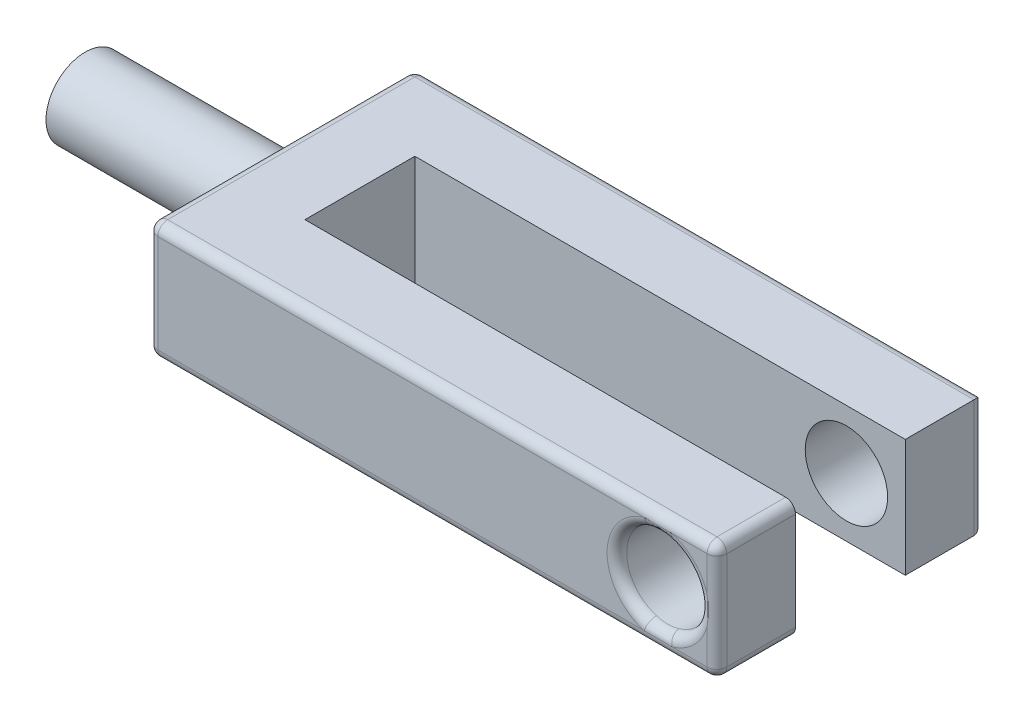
ISO-10303-21;
HEADER;
FILE_DESCRIPTION(('STEP AP214'),'2;1');
FILE_NAME('part.step','',(''),(''),'','','');
FILE_SCHEMA(('AUTOMOTIVE_DESIGN { 1 0 10303 214 1 1 1 1 }'));
ENDSEC;
DATA;
#1=APPLICATION_CONTEXT('core data for automotive mechanical design processes');
#2=APPLICATION_PROTOCOL_DEFINITION('international standard','automotive_design',2000,#1);
#3=PRODUCT_CONTEXT('',#1,'mechanical');
#4=PRODUCT('Part','Part','',(#3));
#5=PRODUCT_RELATED_PRODUCT_CATEGORY('part','',(#4));
#6=PRODUCT_DEFINITION_FORMATION('','',#4);
#7=PRODUCT_DEFINITION_CONTEXT('part definition',#1,'design');
#8=PRODUCT_DEFINITION('design','',#6,#7);
#9=PRODUCT_DEFINITION_SHAPE('','',#8);
#10=(LENGTH_UNIT() NAMED_UNIT(*) SI_UNIT(.MILLI.,.METRE.));
#11=(NAMED_UNIT(*) PLANE_ANGLE_UNIT() SI_UNIT($,.RADIAN.));
#12=(NAMED_UNIT(*) SI_UNIT($,.STERADIAN.) SOLID_ANGLE_UNIT());
#13=UNCERTAINTY_MEASURE_WITH_UNIT(LENGTH_MEASURE(1.E-05),#10,'distance_accuracy_value','');
#14=(GEOMETRIC_REPRESENTATION_CONTEXT(3) GLOBAL_UNCERTAINTY_ASSIGNED_CONTEXT((#13)) GLOBAL_UNIT_ASSIGNED_CONTEXT((#10,
#11,#12)) REPRESENTATION_CONTEXT('',''));
#15=CARTESIAN_POINT('',(0.,0.,0.));
#16=DIRECTION('',(0.,0.,1.));
#17=DIRECTION('',(1.,0.,0.));
#18=AXIS2_PLACEMENT_3D('',#15,#16,#17);
#19=CARTESIAN_POINT('',(-33.,6.,13.6));
#20=DIRECTION('',(0.,0.,-1.));
#21=DIRECTION('',(-1.,0.,0.));
#22=AXIS2_PLACEMENT_3D('',#19,#20,#21);
#23=PLANE('',#22);
#24=DIRECTION('',(1.,0.,0.));
#25=VECTOR('',#24,1.);
#26=CARTESIAN_POINT('',(-33.,-5.,13.6));
#27=LINE('',#26,#25);
#28=CARTESIAN_POINT('',(-32.,-5.,13.6));
#29=VERTEX_POINT('',#28);
#30=CARTESIAN_POINT('',(17.5717143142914,-5.,13.6));
#31=VERTEX_POINT('',#30);
#32=EDGE_CURVE('E296',#29,#31,#27,.T.);
#33=ORIENTED_EDGE('',*,*,#32,.T.);
#34=CARTESIAN_POINT('',(19.,0.,13.6));
#35=DIRECTION('',(0.,0.,-1.));
#36=DIRECTION('',(-1.,0.,0.));
#37=AXIS2_PLACEMENT_3D('',#34,#35,#36);
#38=CIRCLE('',#37,5.2);
#39=CARTESIAN_POINT('',(17.5717143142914,5.,13.6));
#40=VERTEX_POINT('',#39);
#41=EDGE_CURVE('E519',#31,#40,#38,.T.);
#42=ORIENTED_EDGE('',*,*,#41,.T.);
#43=DIRECTION('',(1.,0.,0.));
#44=VECTOR('',#43,1.);
#45=CARTESIAN_POINT('',(-33.,5.,13.6));
#46=LINE('',#45,#44);
#47=CARTESIAN_POINT('',(-32.,5.,13.6));
#48=VERTEX_POINT('',#47);
#49=EDGE_CURVE('E262',#40,#48,#46,.F.);
#50=ORIENTED_EDGE('',*,*,#49,.T.);
#51=DIRECTION('',(0.,-1.,0.));
#52=VECTOR('',#51,1.);
#53=CARTESIAN_POINT('',(-32.,6.,13.6));
#54=LINE('',#53,#52);
#55=EDGE_CURVE('E266',#48,#29,#54,.T.);
#56=ORIENTED_EDGE('',*,*,#55,.T.);
#57=EDGE_LOOP('',(#33,#42,#50,#56));
#58=FACE_BOUND('',#57,.T.);
#59=ADVANCED_FACE('F43',(#58),#23,.F.);
#60=CARTESIAN_POINT('',(19.,0.,13.6));
#61=DIRECTION('',(0.,0.,-1.));
#62=DIRECTION('',(-1.,0.,0.));
#63=AXIS2_PLACEMENT_3D('',#60,#61,#62);
#64=CIRCLE('',#63,5.2);
#65=CARTESIAN_POINT('',(20.4282856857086,5.,13.6));
#66=VERTEX_POINT('',#65);
#67=CARTESIAN_POINT('',(24.,1.42828568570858,13.6));
#68=VERTEX_POINT('',#67);
#69=EDGE_CURVE('E598',#66,#68,#64,.T.);
#70=ORIENTED_EDGE('',*,*,#69,.T.);
#71=DIRECTION('',(0.,-1.,0.));
#72=VECTOR('',#71,1.);
#73=CARTESIAN_POINT('',(24.,6.,13.6));
#74=LINE('',#73,#72);
#75=CARTESIAN_POINT('',(24.,5.,13.6));
#76=VERTEX_POINT('',#75);
#77=EDGE_CURVE('E533',#68,#76,#74,.F.);
#78=ORIENTED_EDGE('',*,*,#77,.T.);
#79=EDGE_CURVE('E265',#76,#66,#46,.F.);
#80=ORIENTED_EDGE('',*,*,#79,.T.);
#81=EDGE_LOOP('',(#70,#78,#80));
#82=FACE_BOUND('',#81,.T.);
#83=ADVANCED_FACE('F464',(#82),#23,.F.);
#84=CARTESIAN_POINT('',(-33.,6.,-13.6));
#85=DIRECTION('',(0.,0.,1.));
#86=DIRECTION('',(1.,0.,0.));
#87=AXIS2_PLACEMENT_3D('',#84,#85,#86);
#88=PLANE('',#87);
#89=CARTESIAN_POINT('',(19.,0.,-13.6));
#90=DIRECTION('',(0.,0.,1.));
#91=DIRECTION('',(1.,0.,0.));
#92=AXIS2_PLACEMENT_3D('',#89,#90,#91);
#93=CIRCLE('',#92,5.2);
#94=CARTESIAN_POINT('',(20.4282856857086,-5.,-13.6));
#95=VERTEX_POINT('',#94);
#96=CARTESIAN_POINT('',(24.,-1.42828568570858,-13.6));
#97=VERTEX_POINT('',#96);
#98=EDGE_CURVE('E322',#95,#97,#93,.T.);
#99=ORIENTED_EDGE('',*,*,#98,.T.);
#100=DIRECTION('',(0.,-1.,0.));
#101=VECTOR('',#100,1.);
#102=CARTESIAN_POINT('',(24.,6.,-13.6));
#103=LINE('',#102,#101);
#104=CARTESIAN_POINT('',(24.,-5.,-13.6));
#105=VERTEX_POINT('',#104);
#106=EDGE_CURVE('E326',#97,#105,#103,.T.);
#107=ORIENTED_EDGE('',*,*,#106,.T.);
#108=DIRECTION('',(-1.,0.,0.));
#109=VECTOR('',#108,1.);
#110=CARTESIAN_POINT('',(-33.,-5.,-13.6));
#111=LINE('',#110,#109);
#112=EDGE_CURVE('E324',#105,#95,#111,.T.);
#113=ORIENTED_EDGE('',*,*,#112,.T.);
#114=EDGE_LOOP('',(#99,#107,#113));
#115=FACE_BOUND('',#114,.T.);
#116=ADVANCED_FACE('F475',(#115),#88,.F.);
#117=DIRECTION('',(-1.,0.,0.));
#118=VECTOR('',#117,1.);
#119=CARTESIAN_POINT('',(25.,5.,-13.6));
#120=LINE('',#119,#118);
#121=CARTESIAN_POINT('',(20.4282856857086,5.,-13.6));
#122=VERTEX_POINT('',#121);
#123=CARTESIAN_POINT('',(24.,5.,-13.6));
#124=VERTEX_POINT('',#123);
#125=EDGE_CURVE('E317',#122,#124,#120,.F.);
#126=ORIENTED_EDGE('',*,*,#125,.T.);
#127=DIRECTION('',(0.,-1.,0.));
#128=VECTOR('',#127,1.);
#129=CARTESIAN_POINT('',(24.,6.,-13.6));
#130=LINE('',#129,#128);
#131=CARTESIAN_POINT('',(24.,1.42828568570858,-13.6));
#132=VERTEX_POINT('',#131);
#133=EDGE_CURVE('E319',#124,#132,#130,.T.);
#134=ORIENTED_EDGE('',*,*,#133,.T.);
#135=CARTESIAN_POINT('',(19.,0.,-13.6));
#136=DIRECTION('',(0.,0.,1.));
#137=DIRECTION('',(1.,0.,0.));
#138=AXIS2_PLACEMENT_3D('',#135,#136,#137);
#139=CIRCLE('',#138,5.2);
#140=EDGE_CURVE('E315',#132,#122,#139,.T.);
#141=ORIENTED_EDGE('',*,*,#140,.T.);
#142=EDGE_LOOP('',(#126,#134,#141));
#143=FACE_BOUND('',#142,.T.);
#144=ADVANCED_FACE('F476',(#143),#88,.F.);
#145=CARTESIAN_POINT('',(25.,6.,-13.6));
#146=DIRECTION('',(-1.,0.,0.));
#147=DIRECTION('',(0.,0.,1.));
#148=AXIS2_PLACEMENT_3D('',#145,#146,#147);
#149=PLANE('',#148);
#150=DIRECTION('',(0.,0.,-1.));
#151=VECTOR('',#150,1.);
#152=CARTESIAN_POINT('',(25.,-6.,-13.6));
#153=LINE('',#152,#151);
#154=CARTESIAN_POINT('',(25.,-6.,-5.6));
#155=VERTEX_POINT('',#154);
#156=CARTESIAN_POINT('',(25.,-6.,-12.6));
#157=VERTEX_POINT('',#156);
#158=EDGE_CURVE('E241',#155,#157,#153,.T.);
#159=ORIENTED_EDGE('',*,*,#158,.T.);
#160=DIRECTION('',(0.,-1.,0.));
#161=VECTOR('',#160,1.);
#162=CARTESIAN_POINT('',(25.,6.,-12.6));
#163=LINE('',#162,#161);
#164=CARTESIAN_POINT('',(25.,6.,-12.6));
#165=VERTEX_POINT('',#164);
#166=EDGE_CURVE('E329',#157,#165,#163,.F.);
#167=ORIENTED_EDGE('',*,*,#166,.T.);
#168=DIRECTION('',(0.,0.,-1.));
#169=VECTOR('',#168,1.);
#170=CARTESIAN_POINT('',(25.,6.,-13.6));
#171=LINE('',#170,#169);
#172=CARTESIAN_POINT('',(25.,6.,-5.6));
#173=VERTEX_POINT('',#172);
#174=EDGE_CURVE('E220',#173,#165,#171,.T.);
#175=ORIENTED_EDGE('',*,*,#174,.F.);
#176=DIRECTION('',(0.,-1.,0.));
#177=VECTOR('',#176,1.);
#178=CARTESIAN_POINT('',(25.,6.,-5.6));
#179=LINE('',#178,#177);
#180=EDGE_CURVE('E237',#173,#155,#179,.T.);
#181=ORIENTED_EDGE('',*,*,#180,.T.);
#182=EDGE_LOOP('',(#159,#167,#175,#181));
#183=FACE_BOUND('',#182,.T.);
#184=ADVANCED_FACE('F473',(#183),#149,.F.);
#185=DIRECTION('',(0.,-1.,0.));
#186=VECTOR('',#185,1.);
#187=CARTESIAN_POINT('',(-32.,6.,-13.6));
#188=LINE('',#187,#186);
#189=CARTESIAN_POINT('',(-32.,-5.,-13.6));
#190=VERTEX_POINT('',#189);
#191=CARTESIAN_POINT('',(-32.,5.,-13.6));
#192=VERTEX_POINT('',#191);
#193=EDGE_CURVE('E310',#190,#192,#188,.F.);
#194=ORIENTED_EDGE('',*,*,#193,.T.);
#195=DIRECTION('',(-1.,0.,0.));
#196=VECTOR('',#195,1.);
#197=CARTESIAN_POINT('',(25.,5.,-13.6));
#198=LINE('',#197,#196);
#199=CARTESIAN_POINT('',(17.5717143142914,5.,-13.6));
#200=VERTEX_POINT('',#199);
#201=EDGE_CURVE('E312',#192,#200,#198,.F.);
#202=ORIENTED_EDGE('',*,*,#201,.T.);
#203=CARTESIAN_POINT('',(19.,0.,-13.6));
#204=DIRECTION('',(0.,0.,1.));
#205=DIRECTION('',(1.,0.,0.));
#206=AXIS2_PLACEMENT_3D('',#203,#204,#205);
#207=CIRCLE('',#206,5.2);
#208=CARTESIAN_POINT('',(17.5717143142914,-5.,-13.6));
#209=VERTEX_POINT('',#208);
#210=EDGE_CURVE('E299',#200,#209,#207,.T.);
#211=ORIENTED_EDGE('',*,*,#210,.T.);
#212=DIRECTION('',(-1.,0.,0.));
#213=VECTOR('',#212,1.);
#214=CARTESIAN_POINT('',(-33.,-5.,-13.6));
#215=LINE('',#214,#213);
#216=EDGE_CURVE('E308',#209,#190,#215,.T.);
#217=ORIENTED_EDGE('',*,*,#216,.T.);
#218=EDGE_LOOP('',(#194,#202,#211,#217));
#219=FACE_BOUND('',#218,.T.);
#220=ADVANCED_FACE('F469',(#219),#88,.F.);
#221=CARTESIAN_POINT('',(-33.,6.,-13.6));
#222=DIRECTION('',(1.,0.,0.));
#223=DIRECTION('',(0.,0.,-1.));
#224=AXIS2_PLACEMENT_3D('',#221,#222,#223);
#225=PLANE('',#224);
#226=CARTESIAN_POINT('',(-33.,0.,0.));
#227=DIRECTION('',(-1.,0.,0.));
#228=DIRECTION('',(0.,0.,1.));
#229=AXIS2_PLACEMENT_3D('',#226,#227,#228);
#230=CIRCLE('',#229,4.);
#231=CARTESIAN_POINT('',(-33.,0.,4.));
#232=VERTEX_POINT('',#231);
#233=EDGE_CURVE('E255',#232,#232,#230,.T.);
#234=ORIENTED_EDGE('',*,*,#233,.F.);
#235=EDGE_LOOP('',(#234));
#236=FACE_BOUND('',#235,.T.);
#237=DIRECTION('',(0.,0.,1.));
#238=VECTOR('',#237,1.);
#239=CARTESIAN_POINT('',(-33.,5.,-13.6));
#240=LINE('',#239,#238);
#241=CARTESIAN_POINT('',(-33.,5.,12.6));
#242=VERTEX_POINT('',#241);
#243=CARTESIAN_POINT('',(-33.,5.,-12.6));
#244=VERTEX_POINT('',#243);
#245=EDGE_CURVE('E269',#242,#244,#240,.F.);
#246=ORIENTED_EDGE('',*,*,#245,.T.);
#247=DIRECTION('',(0.,-1.,0.));
#248=VECTOR('',#247,1.);
#249=CARTESIAN_POINT('',(-33.,6.,-12.6));
#250=LINE('',#249,#248);
#251=CARTESIAN_POINT('',(-33.,-5.,-12.6));
#252=VERTEX_POINT('',#251);
#253=EDGE_CURVE('E336',#244,#252,#250,.T.);
#254=ORIENTED_EDGE('',*,*,#253,.T.);
#255=DIRECTION('',(0.,0.,1.));
#256=VECTOR('',#255,1.);
#257=CARTESIAN_POINT('',(-33.,-5.,-13.6));
#258=LINE('',#257,#256);
#259=CARTESIAN_POINT('',(-33.,-5.,12.6));
#260=VERTEX_POINT('',#259);
#261=EDGE_CURVE('E279',#252,#260,#258,.T.);
#262=ORIENTED_EDGE('',*,*,#261,.T.);
#263=DIRECTION('',(0.,-1.,0.));
#264=VECTOR('',#263,1.);
#265=CARTESIAN_POINT('',(-33.,6.,12.6));
#266=LINE('',#265,#264);
#267=EDGE_CURVE('E272',#260,#242,#266,.F.);
#268=ORIENTED_EDGE('',*,*,#267,.T.);
#269=EDGE_LOOP('',(#246,#254,#262,#268));
#270=FACE_BOUND('',#269,.T.);
#271=ADVANCED_FACE('F462',(#236,#270),#225,.F.);
#272=CARTESIAN_POINT('',(20.4282856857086,-5.,13.6));
#273=VERTEX_POINT('',#272);
#274=CARTESIAN_POINT('',(24.,-5.,13.6));
#275=VERTEX_POINT('',#274);
#276=EDGE_CURVE('E295',#273,#275,#27,.T.);
#277=ORIENTED_EDGE('',*,*,#276,.T.);
#278=DIRECTION('',(0.,-1.,0.));
#279=VECTOR('',#278,1.);
#280=CARTESIAN_POINT('',(24.,6.,13.6));
#281=LINE('',#280,#279);
#282=CARTESIAN_POINT('',(24.,-1.42828568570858,13.6));
#283=VERTEX_POINT('',#282);
#284=EDGE_CURVE('E596',#275,#283,#281,.F.);
#285=ORIENTED_EDGE('',*,*,#284,.T.);
#286=CARTESIAN_POINT('',(19.,0.,13.6));
#287=DIRECTION('',(0.,0.,-1.));
#288=DIRECTION('',(-1.,0.,0.));
#289=AXIS2_PLACEMENT_3D('',#286,#287,#288);
#290=CIRCLE('',#289,5.2);
#291=EDGE_CURVE('E594',#283,#273,#290,.T.);
#292=ORIENTED_EDGE('',*,*,#291,.T.);
#293=EDGE_LOOP('',(#277,#285,#292));
#294=FACE_BOUND('',#293,.T.);
#295=ADVANCED_FACE('F455',(#294),#23,.F.);
#296=CARTESIAN_POINT('',(25.,6.,5.6));
#297=DIRECTION('',(-1.,0.,0.));
#298=DIRECTION('',(0.,0.,1.));
#299=AXIS2_PLACEMENT_3D('',#296,#297,#298);
#300=PLANE('',#299);
#301=DIRECTION('',(0.,-1.,0.));
#302=VECTOR('',#301,1.);
#303=CARTESIAN_POINT('',(25.,6.,5.6));
#304=LINE('',#303,#302);
#305=CARTESIAN_POINT('',(25.,5.,5.6));
#306=VERTEX_POINT('',#305);
#307=CARTESIAN_POINT('',(25.,-5.,5.6));
#308=VERTEX_POINT('',#307);
#309=EDGE_CURVE('E229',#306,#308,#304,.T.);
#310=ORIENTED_EDGE('',*,*,#309,.F.);
#311=DIRECTION('',(0.,0.,-1.));
#312=VECTOR('',#311,1.);
#313=CARTESIAN_POINT('',(25.,5.,12.6));
#314=LINE('',#313,#312);
#315=CARTESIAN_POINT('',(25.,5.,12.6));
#316=VERTEX_POINT('',#315);
#317=EDGE_CURVE('E585',#306,#316,#314,.F.);
#318=ORIENTED_EDGE('',*,*,#317,.T.);
#319=DIRECTION('',(0.,-1.,0.));
#320=VECTOR('',#319,1.);
#321=CARTESIAN_POINT('',(25.,6.,12.6));
#322=LINE('',#321,#320);
#323=CARTESIAN_POINT('',(25.,-5.,12.6));
#324=VERTEX_POINT('',#323);
#325=EDGE_CURVE('E577',#316,#324,#322,.T.);
#326=ORIENTED_EDGE('',*,*,#325,.T.);
#327=DIRECTION('',(0.,0.,-1.));
#328=VECTOR('',#327,1.);
#329=CARTESIAN_POINT('',(25.,-5.,5.6));
#330=LINE('',#329,#328);
#331=EDGE_CURVE('E589',#324,#308,#330,.T.);
#332=ORIENTED_EDGE('',*,*,#331,.T.);
#333=EDGE_LOOP('',(#310,#318,#326,#332));
#334=FACE_BOUND('',#333,.T.);
#335=ADVANCED_FACE('F461',(#334),#300,.F.);
#336=CARTESIAN_POINT('',(-25.,6.,5.6));
#337=DIRECTION('',(0.,0.,1.));
#338=DIRECTION('',(1.,0.,0.));
#339=AXIS2_PLACEMENT_3D('',#336,#337,#338);
#340=PLANE('',#339);
#341=CARTESIAN_POINT('',(19.,0.,5.6));
#342=DIRECTION('',(0.,0.,1.));
#343=DIRECTION('',(1.,0.,0.));
#344=AXIS2_PLACEMENT_3D('',#341,#342,#343);
#345=CIRCLE('',#344,4.2);
#346=CARTESIAN_POINT('',(23.2,0.,5.6));
#347=VERTEX_POINT('',#346);
#348=EDGE_CURVE('E244',#347,#347,#345,.T.);
#349=ORIENTED_EDGE('',*,*,#348,.T.);
#350=EDGE_LOOP('',(#349));
#351=FACE_BOUND('',#350,.T.);
#352=DIRECTION('',(-1.,0.,0.));
#353=VECTOR('',#352,1.);
#354=CARTESIAN_POINT('',(-25.,6.,5.6));
#355=LINE('',#354,#353);
#356=CARTESIAN_POINT('',(24.,6.,5.6));
#357=VERTEX_POINT('',#356);
#358=CARTESIAN_POINT('',(-25.,6.,5.6));
#359=VERTEX_POINT('',#358);
#360=EDGE_CURVE('E210',#357,#359,#355,.T.);
#361=ORIENTED_EDGE('',*,*,#360,.F.);
#362=CARTESIAN_POINT('',(24.,5.,5.6));
#363=DIRECTION('',(0.,0.,1.));
#364=DIRECTION('',(1.,0.,0.));
#365=AXIS2_PLACEMENT_3D('',#362,#363,#364);
#366=CIRCLE('',#365,1.);
#367=EDGE_CURVE('E613',#357,#306,#366,.F.);
#368=ORIENTED_EDGE('',*,*,#367,.T.);
#369=ORIENTED_EDGE('',*,*,#309,.T.);
#370=CARTESIAN_POINT('',(24.,-5.,5.6));
#371=DIRECTION('',(0.,0.,1.));
#372=DIRECTION('',(1.,0.,0.));
#373=AXIS2_PLACEMENT_3D('',#370,#371,#372);
#374=CIRCLE('',#373,1.);
#375=CARTESIAN_POINT('',(24.,-6.,5.6));
#376=VERTEX_POINT('',#375);
#377=EDGE_CURVE('E614',#308,#376,#374,.F.);
#378=ORIENTED_EDGE('',*,*,#377,.T.);
#379=DIRECTION('',(-1.,0.,0.));
#380=VECTOR('',#379,1.);
#381=CARTESIAN_POINT('',(-25.,-6.,5.6));
#382=LINE('',#381,#380);
#383=CARTESIAN_POINT('',(-25.,-6.,5.6));
#384=VERTEX_POINT('',#383);
#385=EDGE_CURVE('E226',#376,#384,#382,.T.);
#386=ORIENTED_EDGE('',*,*,#385,.T.);
#387=DIRECTION('',(0.,-1.,0.));
#388=VECTOR('',#387,1.);
#389=CARTESIAN_POINT('',(-25.,6.,5.6));
#390=LINE('',#389,#388);
#391=EDGE_CURVE('E223',#359,#384,#390,.T.);
#392=ORIENTED_EDGE('',*,*,#391,.F.);
#393=EDGE_LOOP('',(#361,#368,#369,#378,#386,#392));
#394=FACE_BOUND('',#393,.T.);
#395=ADVANCED_FACE('F224',(#351,#394),#340,.F.);
#396=CARTESIAN_POINT('',(-25.,6.,5.6));
#397=DIRECTION('',(-1.,0.,0.));
#398=DIRECTION('',(0.,0.,1.));
#399=AXIS2_PLACEMENT_3D('',#396,#397,#398);
#400=PLANE('',#399);
#401=DIRECTION('',(0.,0.,-1.));
#402=VECTOR('',#401,1.);
#403=CARTESIAN_POINT('',(-25.,-6.,5.6));
#404=LINE('',#403,#402);
#405=CARTESIAN_POINT('',(-25.,-6.,-5.6));
#406=VERTEX_POINT('',#405);
#407=EDGE_CURVE('E246',#384,#406,#404,.T.);
#408=ORIENTED_EDGE('',*,*,#407,.T.);
#409=DIRECTION('',(0.,-1.,0.));
#410=VECTOR('',#409,1.);
#411=CARTESIAN_POINT('',(-25.,6.,-5.6));
#412=LINE('',#411,#410);
#413=CARTESIAN_POINT('',(-25.,6.,-5.6));
#414=VERTEX_POINT('',#413);
#415=EDGE_CURVE('E230',#414,#406,#412,.T.);
#416=ORIENTED_EDGE('',*,*,#415,.F.);
#417=DIRECTION('',(0.,0.,-1.));
#418=VECTOR('',#417,1.);
#419=CARTESIAN_POINT('',(-25.,6.,5.6));
#420=LINE('',#419,#418);
#421=EDGE_CURVE('E215',#359,#414,#420,.T.);
#422=ORIENTED_EDGE('',*,*,#421,.F.);
#423=ORIENTED_EDGE('',*,*,#391,.T.);
#424=EDGE_LOOP('',(#408,#416,#422,#423));
#425=FACE_BOUND('',#424,.T.);
#426=ADVANCED_FACE('F232',(#425),#400,.F.);
#427=CARTESIAN_POINT('',(-25.,6.,-5.6));
#428=DIRECTION('',(0.,0.,-1.));
#429=DIRECTION('',(-1.,0.,0.));
#430=AXIS2_PLACEMENT_3D('',#427,#428,#429);
#431=PLANE('',#430);
#432=CARTESIAN_POINT('',(19.,0.,-5.6));
#433=DIRECTION('',(0.,0.,-1.));
#434=DIRECTION('',(-1.,0.,0.));
#435=AXIS2_PLACEMENT_3D('',#432,#433,#434);
#436=CIRCLE('',#435,4.2);
#437=CARTESIAN_POINT('',(14.8,0.,-5.6));
#438=VERTEX_POINT('',#437);
#439=EDGE_CURVE('E256',#438,#438,#436,.T.);
#440=ORIENTED_EDGE('',*,*,#439,.T.);
#441=EDGE_LOOP('',(#440));
#442=FACE_BOUND('',#441,.T.);
#443=DIRECTION('',(1.,0.,0.));
#444=VECTOR('',#443,1.);
#445=CARTESIAN_POINT('',(-25.,-6.,-5.6));
#446=LINE('',#445,#444);
#447=EDGE_CURVE('E248',#406,#155,#446,.T.);
#448=ORIENTED_EDGE('',*,*,#447,.T.);
#449=ORIENTED_EDGE('',*,*,#180,.F.);
#450=DIRECTION('',(1.,0.,0.));
#451=VECTOR('',#450,1.);
#452=CARTESIAN_POINT('',(-25.,6.,-5.6));
#453=LINE('',#452,#451);
#454=EDGE_CURVE('E235',#414,#173,#453,.T.);
#455=ORIENTED_EDGE('',*,*,#454,.F.);
#456=ORIENTED_EDGE('',*,*,#415,.T.);
#457=EDGE_LOOP('',(#448,#449,#455,#456));
#458=FACE_BOUND('',#457,.T.);
#459=ADVANCED_FACE('F731',(#442,#458),#431,.F.);
#460=CARTESIAN_POINT('',(0.,6.,0.));
#461=DIRECTION('',(0.,1.,0.));
#462=DIRECTION('',(0.,0.,1.));
#463=AXIS2_PLACEMENT_3D('',#460,#461,#462);
#464=PLANE('',#463);
#465=DIRECTION('',(1.,0.,0.));
#466=VECTOR('',#465,1.);
#467=CARTESIAN_POINT('',(25.,6.,12.6));
#468=LINE('',#467,#466);
#469=CARTESIAN_POINT('',(-32.,6.,12.6));
#470=VERTEX_POINT('',#469);
#471=CARTESIAN_POINT('',(24.,6.,12.6));
#472=VERTEX_POINT('',#471);
#473=EDGE_CURVE('E260',#470,#472,#468,.T.);
#474=ORIENTED_EDGE('',*,*,#473,.T.);
#475=DIRECTION('',(0.,0.,-1.));
#476=VECTOR('',#475,1.);
#477=CARTESIAN_POINT('',(24.,6.,5.6));
#478=LINE('',#477,#476);
#479=EDGE_CURVE('E218',#472,#357,#478,.T.);
#480=ORIENTED_EDGE('',*,*,#479,.T.);
#481=ORIENTED_EDGE('',*,*,#360,.T.);
#482=ORIENTED_EDGE('',*,*,#421,.T.);
#483=ORIENTED_EDGE('',*,*,#454,.T.);
#484=ORIENTED_EDGE('',*,*,#174,.T.);
#485=DIRECTION('',(-1.,0.,0.));
#486=VECTOR('',#485,1.);
#487=CARTESIAN_POINT('',(-32.,6.,-12.6));
#488=LINE('',#487,#486);
#489=CARTESIAN_POINT('',(-32.,6.,-12.6));
#490=VERTEX_POINT('',#489);
#491=EDGE_CURVE('E332',#165,#490,#488,.T.);
#492=ORIENTED_EDGE('',*,*,#491,.T.);
#493=DIRECTION('',(0.,0.,1.));
#494=VECTOR('',#493,1.);
#495=CARTESIAN_POINT('',(-32.,6.,12.6));
#496=LINE('',#495,#494);
#497=EDGE_CURVE('E277',#490,#470,#496,.T.);
#498=ORIENTED_EDGE('',*,*,#497,.T.);
#499=EDGE_LOOP('',(#474,#480,#481,#482,#483,#484,#492,#498));
#500=FACE_BOUND('',#499,.T.);
#501=ADVANCED_FACE('F213',(#500),#464,.T.);
#502=CARTESIAN_POINT('',(0.,-6.,0.));
#503=DIRECTION('',(0.,1.,0.));
#504=DIRECTION('',(0.,0.,1.));
#505=AXIS2_PLACEMENT_3D('',#502,#503,#504);
#506=PLANE('',#505);
#507=ORIENTED_EDGE('',*,*,#385,.F.);
#508=DIRECTION('',(0.,0.,-1.));
#509=VECTOR('',#508,1.);
#510=CARTESIAN_POINT('',(24.,-6.,0.));
#511=LINE('',#510,#509);
#512=CARTESIAN_POINT('',(24.,-6.,12.6));
#513=VERTEX_POINT('',#512);
#514=EDGE_CURVE('E584',#376,#513,#511,.F.);
#515=ORIENTED_EDGE('',*,*,#514,.T.);
#516=DIRECTION('',(1.,0.,0.));
#517=VECTOR('',#516,1.);
#518=CARTESIAN_POINT('',(0.,-6.,12.6));
#519=LINE('',#518,#517);
#520=CARTESIAN_POINT('',(-32.,-6.,12.6));
#521=VERTEX_POINT('',#520);
#522=EDGE_CURVE('E288',#513,#521,#519,.F.);
#523=ORIENTED_EDGE('',*,*,#522,.T.);
#524=DIRECTION('',(0.,0.,1.));
#525=VECTOR('',#524,1.);
#526=CARTESIAN_POINT('',(-32.,-6.,0.));
#527=LINE('',#526,#525);
#528=CARTESIAN_POINT('',(-32.,-6.,-12.6));
#529=VERTEX_POINT('',#528);
#530=EDGE_CURVE('E290',#521,#529,#527,.F.);
#531=ORIENTED_EDGE('',*,*,#530,.T.);
#532=DIRECTION('',(-1.,0.,0.));
#533=VECTOR('',#532,1.);
#534=CARTESIAN_POINT('',(0.,-6.,-12.6));
#535=LINE('',#534,#533);
#536=EDGE_CURVE('E340',#529,#157,#535,.F.);
#537=ORIENTED_EDGE('',*,*,#536,.T.);
#538=ORIENTED_EDGE('',*,*,#158,.F.);
#539=ORIENTED_EDGE('',*,*,#447,.F.);
#540=ORIENTED_EDGE('',*,*,#407,.F.);
#541=EDGE_LOOP('',(#507,#515,#523,#531,#537,#538,#539,#540));
#542=FACE_BOUND('',#541,.T.);
#543=ADVANCED_FACE('F630',(#542),#506,.F.);
#544=CARTESIAN_POINT('',(19.,0.,-13.6));
#545=DIRECTION('',(0.,0.,1.));
#546=DIRECTION('',(1.,0.,0.));
#547=AXIS2_PLACEMENT_3D('',#544,#545,#546);
#548=CYLINDRICAL_SURFACE('',#547,4.2);
#549=CARTESIAN_POINT('',(19.,0.,-12.6));
#550=DIRECTION('',(0.,0.,1.));
#551=DIRECTION('',(1.,0.,0.));
#552=AXIS2_PLACEMENT_3D('',#549,#550,#551);
#553=CIRCLE('',#552,4.2);
#554=CARTESIAN_POINT('',(23.2,0.,-12.6));
#555=VERTEX_POINT('',#554);
#556=EDGE_CURVE('E342',#555,#555,#553,.F.);
#557=ORIENTED_EDGE('',*,*,#556,.T.);
#558=EDGE_LOOP('',(#557));
#559=FACE_BOUND('',#558,.T.);
#560=ORIENTED_EDGE('',*,*,#439,.F.);
#561=EDGE_LOOP('',(#560));
#562=FACE_BOUND('',#561,.T.);
#563=ADVANCED_FACE('F789',(#559,#562),#548,.F.);
#564=CARTESIAN_POINT('',(19.,0.,12.6));
#565=DIRECTION('',(0.,0.,-1.));
#566=DIRECTION('',(-1.,0.,0.));
#567=AXIS2_PLACEMENT_3D('',#564,#565,#566);
#568=CIRCLE('',#567,4.2);
#569=CARTESIAN_POINT('',(17.8463846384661,4.03846153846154,12.6));
#570=VERTEX_POINT('',#569);
#571=CARTESIAN_POINT('',(17.8463846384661,-4.03846153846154,12.6));
#572=VERTEX_POINT('',#571);
#573=EDGE_CURVE('E532',#570,#572,#568,.F.);
#574=ORIENTED_EDGE('',*,*,#573,.T.);
#575=CARTESIAN_POINT('',(17.2778373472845,-5.,13.6));
#576=CARTESIAN_POINT('',(17.6410520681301,-3.97421851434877,13.6962887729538));
#577=CARTESIAN_POINT('',(17.6090224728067,-3.96297634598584,12.60437676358));
#578=CARTESIAN_POINT('',(17.3442323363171,-5.,13.6));
#579=CARTESIAN_POINT('',(17.6843466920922,-3.98895765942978,13.670949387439));
#580=CARTESIAN_POINT('',(17.6626491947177,-3.98179956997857,12.6022004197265));
#581=CARTESIAN_POINT('',(17.4111100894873,-5.,13.6));
#582=CARTESIAN_POINT('',(17.7305081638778,-4.00389479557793,13.6479383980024));
#583=CARTESIAN_POINT('',(17.716665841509,-3.99953570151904,12.6009517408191));
#584=CARTESIAN_POINT('',(17.5456999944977,-5.,13.6));
#585=CARTESIAN_POINT('',(17.8264308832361,-4.03300358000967,13.6066733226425));
#586=CARTESIAN_POINT('',(17.8253730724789,-4.03280065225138,12.5998102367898));
#587=CARTESIAN_POINT('',(17.6134119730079,-5.,13.6));
#588=CARTESIAN_POINT('',(17.8762503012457,-4.04722990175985,13.5882685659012));
#589=CARTESIAN_POINT('',(17.8800635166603,-4.04832992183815,12.5999171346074));
#590=CARTESIAN_POINT('',(17.8176105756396,-5.,13.6));
#591=CARTESIAN_POINT('',(18.0285562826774,-4.08744902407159,13.5395559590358));
#592=CARTESIAN_POINT('',(18.0449931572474,-4.09156164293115,12.6015214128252));
#593=CARTESIAN_POINT('',(17.9551922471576,-5.,13.6));
#594=CARTESIAN_POINT('',(18.1370155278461,-4.11201104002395,13.5142798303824));
#595=CARTESIAN_POINT('',(18.1561168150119,-4.11591718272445,12.6043018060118));
#596=CARTESIAN_POINT('',(18.232347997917,-5.,13.6));
#597=CARTESIAN_POINT('',(18.3596644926,-4.15245752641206,13.4756682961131));
#598=CARTESIAN_POINT('',(18.379973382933,-4.15553783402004,12.610253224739));
#599=CARTESIAN_POINT('',(18.371922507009,-5.,13.6));
#600=CARTESIAN_POINT('',(18.4748518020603,-4.16873182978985,13.4618822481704));
#601=CARTESIAN_POINT('',(18.4927066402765,-4.17080095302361,12.6134243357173));
#602=CARTESIAN_POINT('',(18.6521623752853,-5.,13.6));
#603=CARTESIAN_POINT('',(18.7074400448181,-4.19142100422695,13.4432453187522));
#604=CARTESIAN_POINT('',(18.719054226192,-4.1921338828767,12.618173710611));
#605=CARTESIAN_POINT('',(18.7928275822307,-5.,13.6));
#606=CARTESIAN_POINT('',(18.8259654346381,-4.19806234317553,13.4381987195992));
#607=CARTESIAN_POINT('',(18.8326684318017,-4.19820495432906,12.6197521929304));
#608=CARTESIAN_POINT('',(19.0776307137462,-5.,13.6));
#609=CARTESIAN_POINT('',(19.0650716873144,-4.20123231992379,13.4357470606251));
#610=CARTESIAN_POINT('',(19.0627017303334,-4.20114381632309,12.6204915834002));
#611=CARTESIAN_POINT('',(19.2217723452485,-5.,13.6));
#612=CARTESIAN_POINT('',(19.1868813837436,-4.19755155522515,13.4384999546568));
#613=CARTESIAN_POINT('',(19.1791238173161,-4.1977913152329,12.6195946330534));
#614=CARTESIAN_POINT('',(19.5092233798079,-5.,13.6));
#615=CARTESIAN_POINT('',(19.4267098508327,-4.18003759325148,13.4524997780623));
#616=CARTESIAN_POINT('',(19.4112958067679,-4.18143327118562,12.6157384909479));
#617=CARTESIAN_POINT('',(19.6525325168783,-5.,13.6));
#618=CARTESIAN_POINT('',(19.5459573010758,-4.16601839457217,13.4638988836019));
#619=CARTESIAN_POINT('',(19.5270454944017,-4.16842479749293,12.6127786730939));
#620=CARTESIAN_POINT('',(19.9368322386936,-5.,13.6));
#621=CARTESIAN_POINT('',(19.7769224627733,-4.12924456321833,13.4973421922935));
#622=CARTESIAN_POINT('',(19.756672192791,-4.13290455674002,12.6066135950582));
#623=CARTESIAN_POINT('',(20.0778290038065,-5.,13.6));
#624=CARTESIAN_POINT('',(19.8897786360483,-4.10614409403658,13.5197456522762));
#625=CARTESIAN_POINT('',(19.8705541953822,-4.11042492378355,12.6034091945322));
#626=CARTESIAN_POINT('',(20.3570066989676,-5.,13.6));
#627=CARTESIAN_POINT('',(20.104143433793,-4.05381196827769,13.5789824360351));
#628=CARTESIAN_POINT('',(20.0960438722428,-4.05612220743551,12.5996713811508));
#629=CARTESIAN_POINT('',(20.4951892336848,-5.,13.6));
#630=CARTESIAN_POINT('',(20.206517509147,-4.02408570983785,13.6166140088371));
#631=CARTESIAN_POINT('',(20.207652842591,-4.0243046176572,12.5991364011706));
#632=CARTESIAN_POINT('',(20.750848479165,-5.,13.6));
#633=CARTESIAN_POINT('',(20.3814088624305,-3.96743006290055,13.705434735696));
#634=CARTESIAN_POINT('',(20.4141468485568,-3.95606984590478,12.6044312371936));
#635=CARTESIAN_POINT('',(20.8687664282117,-5.,13.6));
#636=CARTESIAN_POINT('',(20.456711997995,-3.94016876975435,13.7556552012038));
#637=CARTESIAN_POINT('',(20.5093882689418,-3.92071370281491,12.6094793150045));
#638=CARTESIAN_POINT('',(21.0426229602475,-5.,13.6));
#639=CARTESIAN_POINT('',(20.5525823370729,-3.90407280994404,13.8441286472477));
#640=CARTESIAN_POINT('',(20.6498108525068,-3.86273131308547,12.6236518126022));
#641=CARTESIAN_POINT('',(21.1000945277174,-5.,13.6));
#642=CARTESIAN_POINT('',(20.5822321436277,-3.8926149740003,13.8766924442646));
#643=CARTESIAN_POINT('',(20.6962301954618,-3.84256993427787,12.6294797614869));
#644=CARTESIAN_POINT('',(21.2138624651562,-5.,13.6));
#645=CARTESIAN_POINT('',(20.6347313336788,-3.87258903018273,13.9470854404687));
#646=CARTESIAN_POINT('',(20.7881196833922,-3.80068237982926,12.6439401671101));
#647=CARTESIAN_POINT('',(21.2701576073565,-5.,13.6));
#648=CARTESIAN_POINT('',(20.6574317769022,-3.86408702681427,13.9851668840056));
#649=CARTESIAN_POINT('',(20.8335888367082,-3.77895466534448,12.6525754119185));
#650=CARTESIAN_POINT('',(21.3257314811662,-5.,13.6));
#651=CARTESIAN_POINT('',(20.6754351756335,-3.85803720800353,14.0254093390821));
#652=CARTESIAN_POINT('',(20.8784754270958,-3.75650503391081,12.6629104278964));
#653=(BOUNDED_SURFACE() B_SPLINE_SURFACE(3,2,((#575,#576,#577),(#578,#579,#580),(#581,#582,
#583),(#584,#585,#586),(#587,#588,#589),(#590,#591,#592),(#593,#594,#595),(#596,#597,#598),
(#599,#600,#601),(#602,#603,#604),(#605,#606,#607),(#608,#609,#610),(#611,#612,#613),(#614,#615,
#616),(#617,#618,#619),(#620,#621,#622),(#623,#624,#625),(#626,#627,#628),(#629,#630,#631),
(#632,#633,#634),(#635,#636,#637),(#638,#639,#640),(#641,#642,#643),(#644,#645,#646),(#647,#648,
#649),(#650,#651,#652)),.UNSPECIFIED.,.F.,.F.,.F.) B_SPLINE_SURFACE_WITH_KNOTS((4,2,2,2,2,2,2,2,
2,2,2,2,4),(3,3),(0.,0.211148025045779,0.422252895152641,0.844360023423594,1.2665596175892,
1.6887013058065,2.12079276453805,2.55301542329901,2.98378328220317,3.41429822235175,
3.79137892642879,3.98007302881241,4.16895510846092),(0.,1.),
.UNSPECIFIED.) GEOMETRIC_REPRESENTATION_ITEM() RATIONAL_B_SPLINE_SURFACE(((1.,0.675209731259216,
1.),(1.,0.683195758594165,1.),(1.,0.690696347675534,1.),(1.,0.704729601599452,1.),(1.,
0.711262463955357,1.),(1.,0.729415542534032,1.),(1.,0.739594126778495,1.),(1.,0.756120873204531,
1.),(1.,0.762468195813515,1.),(1.,0.771333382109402,1.),(1.,0.773851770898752,1.),(1.,
0.775071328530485,1.),(1.,0.773681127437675,1.),(1.,0.766887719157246,1.),(1.,0.761483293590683,
1.),(1.,0.746685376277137,1.),(1.,0.737305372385,1.),(1.,0.71454834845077,1.),(1.,
0.701173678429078,1.),(1.,0.672302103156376,1.),(1.,0.657274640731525,1.),(1.,0.632426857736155,
1.),(1.,0.623755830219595,1.),(1.,0.605652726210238,1.),(1.,0.596219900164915,1.),(1.,
0.5864182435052,1.))) REPRESENTATION_ITEM('') SURFACE());
#654=CARTESIAN_POINT('',(17.6090224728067,-3.96297634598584,12.60437676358));
#655=CARTESIAN_POINT('',(17.6626491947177,-3.98179956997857,12.6022004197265));
#656=CARTESIAN_POINT('',(17.716665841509,-3.99953570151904,12.6009517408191));
#657=CARTESIAN_POINT('',(17.8253730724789,-4.03280065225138,12.5998102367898));
#658=CARTESIAN_POINT('',(17.8800635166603,-4.04832992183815,12.5999171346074));
#659=CARTESIAN_POINT('',(18.0449931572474,-4.09156164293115,12.6015214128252));
#660=CARTESIAN_POINT('',(18.1561168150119,-4.11591718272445,12.6043018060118));
#661=CARTESIAN_POINT('',(18.379973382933,-4.15553783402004,12.610253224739));
#662=CARTESIAN_POINT('',(18.4927066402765,-4.17080095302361,12.6134243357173));
#663=CARTESIAN_POINT('',(18.719054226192,-4.1921338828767,12.618173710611));
#664=CARTESIAN_POINT('',(18.8326684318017,-4.19820495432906,12.6197521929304));
#665=CARTESIAN_POINT('',(19.0627017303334,-4.20114381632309,12.6204915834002));
#666=CARTESIAN_POINT('',(19.1791238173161,-4.1977913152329,12.6195946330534));
#667=CARTESIAN_POINT('',(19.4112958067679,-4.18143327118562,12.6157384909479));
#668=CARTESIAN_POINT('',(19.5270454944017,-4.16842479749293,12.6127786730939));
#669=CARTESIAN_POINT('',(19.756672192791,-4.13290455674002,12.6066135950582));
#670=CARTESIAN_POINT('',(19.8705541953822,-4.11042492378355,12.6034091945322));
#671=CARTESIAN_POINT('',(20.0960438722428,-4.05612220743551,12.5996713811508));
#672=CARTESIAN_POINT('',(20.207652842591,-4.0243046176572,12.5991364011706));
#673=CARTESIAN_POINT('',(20.4141468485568,-3.95606984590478,12.6044312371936));
#674=CARTESIAN_POINT('',(20.5093882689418,-3.92071370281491,12.6094793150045));
#675=CARTESIAN_POINT('',(20.6498108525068,-3.86273131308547,12.6236518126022));
#676=CARTESIAN_POINT('',(20.6962301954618,-3.84256993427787,12.6294797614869));
#677=CARTESIAN_POINT('',(20.7881196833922,-3.80068237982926,12.6439401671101));
#678=CARTESIAN_POINT('',(20.8335888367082,-3.77895466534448,12.6525754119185));
#679=CARTESIAN_POINT('',(20.8784754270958,-3.75650503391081,12.6629104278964));
#680=B_SPLINE_CURVE_WITH_KNOTS('',3,(#654,#655,#656,#657,#658,#659,#660,#661,#662,#663,#664,
#665,#666,#667,#668,#669,#670,#671,#672,#673,#674,#675,#676,#677,#678,#679),.UNSPECIFIED.,.F.,
.F.,(4,2,2,2,2,2,2,2,2,2,2,2,4),(0.,0.211148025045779,0.422252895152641,0.844360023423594,
1.2665596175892,1.6887013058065,2.12079276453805,2.55301542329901,2.98378328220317,
3.41429822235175,3.79137892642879,3.98007302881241,4.16895510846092),.UNSPECIFIED.);
#681=CARTESIAN_POINT('',(20.1536153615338,-4.03846153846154,12.6));
#682=VERTEX_POINT('',#681);
#683=EDGE_CURVE('E11',#572,#682,#680,.T.);
#684=ORIENTED_EDGE('',*,*,#683,.T.);
#685=CARTESIAN_POINT('',(19.,0.,12.6));
#686=DIRECTION('',(0.,0.,-1.));
#687=DIRECTION('',(-1.,0.,0.));
#688=AXIS2_PLACEMENT_3D('',#685,#686,#687);
#689=CIRCLE('',#688,4.2);
#690=CARTESIAN_POINT('',(20.1536153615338,4.03846153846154,12.6));
#691=VERTEX_POINT('',#690);
#692=EDGE_CURVE('E58',#682,#691,#689,.F.);
#693=ORIENTED_EDGE('',*,*,#692,.T.);
#694=CARTESIAN_POINT('',(20.7221626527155,5.,13.6));
#695=CARTESIAN_POINT('',(20.3589479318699,3.97421851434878,13.6962887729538));
#696=CARTESIAN_POINT('',(20.3909775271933,3.96297634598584,12.60437676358));
#697=CARTESIAN_POINT('',(20.6557676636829,5.,13.6));
#698=CARTESIAN_POINT('',(20.3156533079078,3.98895765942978,13.670949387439));
#699=CARTESIAN_POINT('',(20.3373508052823,3.98179956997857,12.6022004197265));
#700=CARTESIAN_POINT('',(20.5888899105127,5.,13.6));
#701=CARTESIAN_POINT('',(20.2694918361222,4.00389479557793,13.6479383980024));
#702=CARTESIAN_POINT('',(20.283334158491,3.99953570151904,12.6009517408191));
#703=CARTESIAN_POINT('',(20.4543000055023,5.,13.6));
#704=CARTESIAN_POINT('',(20.1735691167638,4.03300358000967,13.6066733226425));
#705=CARTESIAN_POINT('',(20.1746269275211,4.03280065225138,12.5998102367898));
#706=CARTESIAN_POINT('',(20.386588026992,5.,13.6));
#707=CARTESIAN_POINT('',(20.1237496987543,4.04722990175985,13.5882685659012));
#708=CARTESIAN_POINT('',(20.1199364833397,4.04832992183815,12.5999171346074));
#709=CARTESIAN_POINT('',(20.1823894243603,5.,13.6));
#710=CARTESIAN_POINT('',(19.9714437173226,4.08744902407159,13.5395559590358));
#711=CARTESIAN_POINT('',(19.9550068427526,4.09156164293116,12.6015214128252));
#712=CARTESIAN_POINT('',(20.0448077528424,5.,13.6));
#713=CARTESIAN_POINT('',(19.8629844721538,4.11201104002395,13.5142798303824));
#714=CARTESIAN_POINT('',(19.8438831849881,4.11591718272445,12.6043018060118));
#715=CARTESIAN_POINT('',(19.7676520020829,5.,13.6));
#716=CARTESIAN_POINT('',(19.6403355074,4.15245752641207,13.4756682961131));
#717=CARTESIAN_POINT('',(19.620026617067,4.15553783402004,12.610253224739));
#718=CARTESIAN_POINT('',(19.6280774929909,5.,13.6));
#719=CARTESIAN_POINT('',(19.5251481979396,4.16873182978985,13.4618822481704));
#720=CARTESIAN_POINT('',(19.5072933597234,4.17080095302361,12.6134243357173));
#721=CARTESIAN_POINT('',(19.3478376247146,5.,13.6));
#722=CARTESIAN_POINT('',(19.2925599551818,4.19142100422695,13.4432453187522));
#723=CARTESIAN_POINT('',(19.280945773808,4.1921338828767,12.618173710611));
#724=CARTESIAN_POINT('',(19.2071724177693,5.,13.6));
#725=CARTESIAN_POINT('',(19.1740345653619,4.19806234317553,13.4381987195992));
#726=CARTESIAN_POINT('',(19.1673315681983,4.19820495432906,12.6197521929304));
#727=CARTESIAN_POINT('',(18.9223692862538,5.,13.6));
#728=CARTESIAN_POINT('',(18.9349283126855,4.20123231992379,13.4357470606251));
#729=CARTESIAN_POINT('',(18.9372982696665,4.20114381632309,12.6204915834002));
#730=CARTESIAN_POINT('',(18.7782276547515,5.,13.6));
#731=CARTESIAN_POINT('',(18.8131186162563,4.19755155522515,13.4384999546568));
#732=CARTESIAN_POINT('',(18.8208761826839,4.1977913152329,12.6195946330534));
#733=CARTESIAN_POINT('',(18.490776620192,5.,13.6));
#734=CARTESIAN_POINT('',(18.5732901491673,4.18003759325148,13.4524997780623));
#735=CARTESIAN_POINT('',(18.588704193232,4.18143327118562,12.6157384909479));
#736=CARTESIAN_POINT('',(18.3474674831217,5.,13.6));
#737=CARTESIAN_POINT('',(18.4540426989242,4.16601839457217,13.463898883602));
#738=CARTESIAN_POINT('',(18.4729545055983,4.16842479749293,12.6127786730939));
#739=CARTESIAN_POINT('',(18.0631677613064,5.,13.6));
#740=CARTESIAN_POINT('',(18.2230775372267,4.12924456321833,13.4973421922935));
#741=CARTESIAN_POINT('',(18.243327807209,4.13290455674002,12.6066135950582));
#742=CARTESIAN_POINT('',(17.9221709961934,5.,13.6));
#743=CARTESIAN_POINT('',(18.1102213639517,4.10614409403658,13.5197456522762));
#744=CARTESIAN_POINT('',(18.1294458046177,4.11042492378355,12.6034091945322));
#745=CARTESIAN_POINT('',(17.6429933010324,5.,13.6));
#746=CARTESIAN_POINT('',(17.8958565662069,4.05381196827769,13.5789824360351));
#747=CARTESIAN_POINT('',(17.9039561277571,4.0561222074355,12.5996713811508));
#748=CARTESIAN_POINT('',(17.5048107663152,5.,13.6));
#749=CARTESIAN_POINT('',(17.793482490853,4.02408570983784,13.6166140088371));
#750=CARTESIAN_POINT('',(17.792347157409,4.02430461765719,12.5991364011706));
#751=CARTESIAN_POINT('',(17.249151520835,5.,13.6));
#752=CARTESIAN_POINT('',(17.6185911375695,3.96743006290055,13.705434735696));
#753=CARTESIAN_POINT('',(17.5858531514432,3.95606984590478,12.6044312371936));
#754=CARTESIAN_POINT('',(17.1312335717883,5.,13.6));
#755=CARTESIAN_POINT('',(17.543288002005,3.94016876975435,13.7556552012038));
#756=CARTESIAN_POINT('',(17.4906117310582,3.92071370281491,12.6094793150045));
#757=CARTESIAN_POINT('',(16.9573770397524,5.,13.6));
#758=CARTESIAN_POINT('',(17.4474176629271,3.90407280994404,13.8441286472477));
#759=CARTESIAN_POINT('',(17.3501891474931,3.86273131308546,12.6236518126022));
#760=CARTESIAN_POINT('',(16.8999054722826,5.,13.6));
#761=CARTESIAN_POINT('',(17.4177678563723,3.8926149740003,13.8766924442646));
#762=CARTESIAN_POINT('',(17.3037698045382,3.84256993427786,12.6294797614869));
#763=CARTESIAN_POINT('',(16.7861375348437,5.,13.6));
#764=CARTESIAN_POINT('',(17.3652686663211,3.87258903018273,13.9470854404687));
#765=CARTESIAN_POINT('',(17.2118803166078,3.80068237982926,12.6439401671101));
#766=CARTESIAN_POINT('',(16.7298423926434,5.,13.6));
#767=CARTESIAN_POINT('',(17.3425682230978,3.86408702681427,13.9851668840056));
#768=CARTESIAN_POINT('',(17.1664111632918,3.77895466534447,12.6525754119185));
#769=CARTESIAN_POINT('',(16.6742685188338,5.,13.6));
#770=CARTESIAN_POINT('',(17.3245648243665,3.85803720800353,14.0254093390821));
#771=CARTESIAN_POINT('',(17.1215245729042,3.75650503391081,12.6629104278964));
#772=(BOUNDED_SURFACE() B_SPLINE_SURFACE(3,2,((#694,#695,#696),(#697,#698,#699),(#700,#701,
#702),(#703,#704,#705),(#706,#707,#708),(#709,#710,#711),(#712,#713,#714),(#715,#716,#717),
(#718,#719,#720),(#721,#722,#723),(#724,#725,#726),(#727,#728,#729),(#730,#731,#732),(#733,#734,
#735),(#736,#737,#738),(#739,#740,#741),(#742,#743,#744),(#745,#746,#747),(#748,#749,#750),
(#751,#752,#753),(#754,#755,#756),(#757,#758,#759),(#760,#761,#762),(#763,#764,#765),(#766,#767,
#768),(#769,#770,#771)),.UNSPECIFIED.,.F.,.F.,.F.) B_SPLINE_SURFACE_WITH_KNOTS((4,2,2,2,2,2,2,2,
2,2,2,2,4),(3,3),(0.,0.211148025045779,0.422252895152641,0.844360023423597,1.26655961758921,
1.68870130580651,2.12079276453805,2.55301542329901,2.98378328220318,3.41429822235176,
3.7913789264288,3.98007302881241,4.16895510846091),(0.,1.),
.UNSPECIFIED.) GEOMETRIC_REPRESENTATION_ITEM() RATIONAL_B_SPLINE_SURFACE(((1.,0.675209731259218,
1.),(1.,0.683195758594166,1.),(1.,0.690696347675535,1.),(1.,0.704729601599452,1.),(1.,
0.711262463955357,1.),(1.,0.729415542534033,1.),(1.,0.739594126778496,1.),(1.,0.756120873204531,
1.),(1.,0.762468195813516,1.),(1.,0.771333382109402,1.),(1.,0.773851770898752,1.),(1.,
0.775071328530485,1.),(1.,0.773681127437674,1.),(1.,0.766887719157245,1.),(1.,0.761483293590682,
1.),(1.,0.746685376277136,1.),(1.,0.737305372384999,1.),(1.,0.714548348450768,1.),(1.,
0.701173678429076,1.),(1.,0.672302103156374,1.),(1.,0.657274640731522,1.),(1.,0.632426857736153,
1.),(1.,0.623755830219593,1.),(1.,0.605652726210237,1.),(1.,0.596219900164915,1.),(1.,
0.5864182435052,1.))) REPRESENTATION_ITEM('') SURFACE());
#773=CARTESIAN_POINT('',(20.3909775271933,3.96297634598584,12.60437676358));
#774=CARTESIAN_POINT('',(20.3373508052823,3.98179956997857,12.6022004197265));
#775=CARTESIAN_POINT('',(20.283334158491,3.99953570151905,12.6009517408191));
#776=CARTESIAN_POINT('',(20.1746269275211,4.03280065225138,12.5998102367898));
#777=CARTESIAN_POINT('',(20.1199364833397,4.04832992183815,12.5999171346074));
#778=CARTESIAN_POINT('',(19.9550068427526,4.09156164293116,12.6015214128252));
#779=CARTESIAN_POINT('',(19.8438831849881,4.11591718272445,12.6043018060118));
#780=CARTESIAN_POINT('',(19.620026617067,4.15553783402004,12.610253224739));
#781=CARTESIAN_POINT('',(19.5072933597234,4.17080095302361,12.6134243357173));
#782=CARTESIAN_POINT('',(19.280945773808,4.1921338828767,12.618173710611));
#783=CARTESIAN_POINT('',(19.1673315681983,4.19820495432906,12.6197521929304));
#784=CARTESIAN_POINT('',(18.9372982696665,4.20114381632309,12.6204915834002));
#785=CARTESIAN_POINT('',(18.8208761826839,4.1977913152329,12.6195946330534));
#786=CARTESIAN_POINT('',(18.588704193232,4.18143327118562,12.6157384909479));
#787=CARTESIAN_POINT('',(18.4729545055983,4.16842479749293,12.6127786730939));
#788=CARTESIAN_POINT('',(18.243327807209,4.13290455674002,12.6066135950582));
#789=CARTESIAN_POINT('',(18.1294458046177,4.11042492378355,12.6034091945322));
#790=CARTESIAN_POINT('',(17.9039561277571,4.0561222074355,12.5996713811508));
#791=CARTESIAN_POINT('',(17.792347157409,4.02430461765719,12.5991364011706));
#792=CARTESIAN_POINT('',(17.5858531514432,3.95606984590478,12.6044312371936));
#793=CARTESIAN_POINT('',(17.4906117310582,3.92071370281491,12.6094793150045));
#794=CARTESIAN_POINT('',(17.3501891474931,3.86273131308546,12.6236518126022));
#795=CARTESIAN_POINT('',(17.3037698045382,3.84256993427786,12.6294797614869));
#796=CARTESIAN_POINT('',(17.2118803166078,3.80068237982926,12.6439401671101));
#797=CARTESIAN_POINT('',(17.1664111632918,3.77895466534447,12.6525754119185));
#798=CARTESIAN_POINT('',(17.1215245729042,3.75650503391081,12.6629104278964));
#799=B_SPLINE_CURVE_WITH_KNOTS('',3,(#773,#774,#775,#776,#777,#778,#779,#780,#781,#782,#783,
#784,#785,#786,#787,#788,#789,#790,#791,#792,#793,#794,#795,#796,#797,#798),.UNSPECIFIED.,.F.,
.F.,(4,2,2,2,2,2,2,2,2,2,2,2,4),(0.,0.211148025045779,0.422252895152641,0.844360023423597,
1.26655961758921,1.68870130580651,2.12079276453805,2.55301542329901,2.98378328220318,
3.41429822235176,3.7913789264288,3.98007302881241,4.16895510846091),.UNSPECIFIED.);
#800=EDGE_CURVE('E601',#691,#570,#799,.T.);
#801=ORIENTED_EDGE('',*,*,#800,.T.);
#802=EDGE_LOOP('',(#574,#684,#693,#801));
#803=FACE_BOUND('',#802,.T.);
#804=ORIENTED_EDGE('',*,*,#348,.F.);
#805=EDGE_LOOP('',(#804));
#806=FACE_BOUND('',#805,.T.);
#807=ADVANCED_FACE('F431',(#803,#806),#548,.F.);
#808=CARTESIAN_POINT('',(-53.,0.,0.));
#809=DIRECTION('',(1.,0.,0.));
#810=DIRECTION('',(0.,0.,-1.));
#811=AXIS2_PLACEMENT_3D('',#808,#809,#810);
#812=CYLINDRICAL_SURFACE('',#811,4.);
#813=CARTESIAN_POINT('',(-53.,0.,0.));
#814=DIRECTION('',(-1.,0.,0.));
#815=DIRECTION('',(0.,0.,1.));
#816=AXIS2_PLACEMENT_3D('',#813,#814,#815);
#817=CIRCLE('',#816,4.);
#818=CARTESIAN_POINT('',(-53.,0.,4.));
#819=VERTEX_POINT('',#818);
#820=EDGE_CURVE('E259',#819,#819,#817,.T.);
#821=ORIENTED_EDGE('',*,*,#820,.F.);
#822=EDGE_LOOP('',(#821));
#823=FACE_BOUND('',#822,.T.);
#824=ORIENTED_EDGE('',*,*,#233,.T.);
#825=EDGE_LOOP('',(#824));
#826=FACE_BOUND('',#825,.T.);
#827=ADVANCED_FACE('F716',(#823,#826),#812,.T.);
#828=CARTESIAN_POINT('',(-53.,0.,0.));
#829=DIRECTION('',(-1.,0.,0.));
#830=DIRECTION('',(0.,0.,1.));
#831=AXIS2_PLACEMENT_3D('',#828,#829,#830);
#832=PLANE('',#831);
#833=ORIENTED_EDGE('',*,*,#820,.T.);
#834=EDGE_LOOP('',(#833));
#835=FACE_BOUND('',#834,.T.);
#836=ADVANCED_FACE('F484',(#835),#832,.T.);
#837=CARTESIAN_POINT('',(0.,5.,12.6));
#838=DIRECTION('',(-1.,0.,0.));
#839=DIRECTION('',(0.,0.,1.));
#840=AXIS2_PLACEMENT_3D('',#837,#838,#839);
#841=CYLINDRICAL_SURFACE('',#840,1.);
#842=ORIENTED_EDGE('',*,*,#79,.F.);
#843=CARTESIAN_POINT('',(24.,5.,12.6));
#844=DIRECTION('',(-1.,0.,0.));
#845=DIRECTION('',(0.,0.,1.));
#846=AXIS2_PLACEMENT_3D('',#843,#844,#845);
#847=CIRCLE('',#846,1.);
#848=EDGE_CURVE('E581',#76,#472,#847,.T.);
#849=ORIENTED_EDGE('',*,*,#848,.T.);
#850=ORIENTED_EDGE('',*,*,#473,.F.);
#851=CARTESIAN_POINT('',(-32.,5.,12.6));
#852=DIRECTION('',(-1.,0.,0.));
#853=DIRECTION('',(0.,0.,1.));
#854=AXIS2_PLACEMENT_3D('',#851,#852,#853);
#855=CIRCLE('',#854,1.);
#856=EDGE_CURVE('E274',#470,#48,#855,.F.);
#857=ORIENTED_EDGE('',*,*,#856,.T.);
#858=ORIENTED_EDGE('',*,*,#49,.F.);
#859=EDGE_CURVE('E264',#66,#40,#46,.F.);
#860=ORIENTED_EDGE('',*,*,#859,.F.);
#861=EDGE_LOOP('',(#842,#849,#850,#857,#858,#860));
#862=FACE_BOUND('',#861,.T.);
#863=ADVANCED_FACE('F480',(#862),#841,.T.);
#864=CARTESIAN_POINT('',(-32.,5.,0.));
#865=DIRECTION('',(0.,0.,-1.));
#866=DIRECTION('',(-1.,0.,0.));
#867=AXIS2_PLACEMENT_3D('',#864,#865,#866);
#868=CYLINDRICAL_SURFACE('',#867,1.);
#869=ORIENTED_EDGE('',*,*,#497,.F.);
#870=CARTESIAN_POINT('',(-32.,5.,-12.6));
#871=DIRECTION('',(0.,0.,-1.));
#872=DIRECTION('',(-1.,0.,0.));
#873=AXIS2_PLACEMENT_3D('',#870,#871,#872);
#874=CIRCLE('',#873,1.);
#875=EDGE_CURVE('E334',#490,#244,#874,.F.);
#876=ORIENTED_EDGE('',*,*,#875,.T.);
#877=ORIENTED_EDGE('',*,*,#245,.F.);
#878=CARTESIAN_POINT('',(-32.,5.,12.6));
#879=DIRECTION('',(0.,0.,1.));
#880=DIRECTION('',(1.,0.,0.));
#881=AXIS2_PLACEMENT_3D('',#878,#879,#880);
#882=CIRCLE('',#881,1.);
#883=EDGE_CURVE('E283',#470,#242,#882,.T.);
#884=ORIENTED_EDGE('',*,*,#883,.F.);
#885=EDGE_LOOP('',(#869,#876,#877,#884));
#886=FACE_BOUND('',#885,.T.);
#887=ADVANCED_FACE('F483',(#886),#868,.T.);
#888=CARTESIAN_POINT('',(-32.,5.,12.6));
#889=DIRECTION('',(1.,0.,0.));
#890=DIRECTION('',(0.,0.,-1.));
#891=AXIS2_PLACEMENT_3D('',#888,#889,#890);
#892=SPHERICAL_SURFACE('',#891,1.);
#893=ORIENTED_EDGE('',*,*,#856,.F.);
#894=ORIENTED_EDGE('',*,*,#883,.T.);
#895=CARTESIAN_POINT('',(-32.,5.,12.6));
#896=DIRECTION('',(0.,-1.,0.));
#897=DIRECTION('',(0.,0.,-1.));
#898=AXIS2_PLACEMENT_3D('',#895,#896,#897);
#899=CIRCLE('',#898,1.);
#900=EDGE_CURVE('E280',#48,#242,#899,.T.);
#901=ORIENTED_EDGE('',*,*,#900,.F.);
#902=EDGE_LOOP('',(#893,#894,#901));
#903=FACE_BOUND('',#902,.T.);
#904=ADVANCED_FACE('F490',(#903),#892,.T.);
#905=CARTESIAN_POINT('',(-32.,6.,12.6));
#906=DIRECTION('',(0.,-1.,0.));
#907=DIRECTION('',(0.,0.,-1.));
#908=AXIS2_PLACEMENT_3D('',#905,#906,#907);
#909=CYLINDRICAL_SURFACE('',#908,1.);
#910=ORIENTED_EDGE('',*,*,#267,.F.);
#911=CARTESIAN_POINT('',(-32.,-5.,12.6));
#912=DIRECTION('',(0.,-1.,0.));
#913=DIRECTION('',(0.,0.,-1.));
#914=AXIS2_PLACEMENT_3D('',#911,#912,#913);
#915=CIRCLE('',#914,1.);
#916=EDGE_CURVE('E293',#260,#29,#915,.F.);
#917=ORIENTED_EDGE('',*,*,#916,.T.);
#918=ORIENTED_EDGE('',*,*,#55,.F.);
#919=ORIENTED_EDGE('',*,*,#900,.T.);
#920=EDGE_LOOP('',(#910,#917,#918,#919));
#921=FACE_BOUND('',#920,.T.);
#922=ADVANCED_FACE('F486',(#921),#909,.T.);
#923=CARTESIAN_POINT('',(-33.,-5.,12.6));
#924=DIRECTION('',(1.,0.,0.));
#925=DIRECTION('',(0.,0.,-1.));
#926=AXIS2_PLACEMENT_3D('',#923,#924,#925);
#927=CYLINDRICAL_SURFACE('',#926,1.);
#928=ORIENTED_EDGE('',*,*,#522,.F.);
#929=CARTESIAN_POINT('',(24.,-5.,12.6));
#930=DIRECTION('',(1.,0.,0.));
#931=DIRECTION('',(0.,0.,-1.));
#932=AXIS2_PLACEMENT_3D('',#929,#930,#931);
#933=CIRCLE('',#932,1.);
#934=EDGE_CURVE('E587',#513,#275,#933,.F.);
#935=ORIENTED_EDGE('',*,*,#934,.T.);
#936=ORIENTED_EDGE('',*,*,#276,.F.);
#937=EDGE_CURVE('E300',#31,#273,#27,.T.);
#938=ORIENTED_EDGE('',*,*,#937,.F.);
#939=ORIENTED_EDGE('',*,*,#32,.F.);
#940=CARTESIAN_POINT('',(-32.,-5.,12.6));
#941=DIRECTION('',(-1.,0.,0.));
#942=DIRECTION('',(0.,0.,1.));
#943=AXIS2_PLACEMENT_3D('',#940,#941,#942);
#944=CIRCLE('',#943,1.);
#945=EDGE_CURVE('E284',#521,#29,#944,.T.);
#946=ORIENTED_EDGE('',*,*,#945,.F.);
#947=EDGE_LOOP('',(#928,#935,#936,#938,#939,#946));
#948=FACE_BOUND('',#947,.T.);
#949=ADVANCED_FACE('F489',(#948),#927,.T.);
#950=CARTESIAN_POINT('',(-32.,-5.,12.6));
#951=DIRECTION('',(0.,1.,0.));
#952=DIRECTION('',(0.,0.,1.));
#953=AXIS2_PLACEMENT_3D('',#950,#951,#952);
#954=SPHERICAL_SURFACE('',#953,1.);
#955=ORIENTED_EDGE('',*,*,#945,.T.);
#956=ORIENTED_EDGE('',*,*,#916,.F.);
#957=CARTESIAN_POINT('',(-32.,-5.,12.6));
#958=DIRECTION('',(0.,0.,-1.));
#959=DIRECTION('',(-1.,0.,0.));
#960=AXIS2_PLACEMENT_3D('',#957,#958,#959);
#961=CIRCLE('',#960,1.);
#962=EDGE_CURVE('E301',#521,#260,#961,.T.);
#963=ORIENTED_EDGE('',*,*,#962,.F.);
#964=EDGE_LOOP('',(#955,#956,#963));
#965=FACE_BOUND('',#964,.T.);
#966=ADVANCED_FACE('F500',(#965),#954,.T.);
#967=CARTESIAN_POINT('',(-32.,-5.,-13.6));
#968=DIRECTION('',(0.,0.,1.));
#969=DIRECTION('',(1.,0.,0.));
#970=AXIS2_PLACEMENT_3D('',#967,#968,#969);
#971=CYLINDRICAL_SURFACE('',#970,1.);
#972=ORIENTED_EDGE('',*,*,#261,.F.);
#973=CARTESIAN_POINT('',(-32.,-5.,-12.6));
#974=DIRECTION('',(0.,0.,1.));
#975=DIRECTION('',(1.,0.,0.));
#976=AXIS2_PLACEMENT_3D('',#973,#974,#975);
#977=CIRCLE('',#976,1.);
#978=EDGE_CURVE('E338',#252,#529,#977,.T.);
#979=ORIENTED_EDGE('',*,*,#978,.T.);
#980=ORIENTED_EDGE('',*,*,#530,.F.);
#981=ORIENTED_EDGE('',*,*,#962,.T.);
#982=EDGE_LOOP('',(#972,#979,#980,#981));
#983=FACE_BOUND('',#982,.T.);
#984=ADVANCED_FACE('F407',(#983),#971,.T.);
#985=CARTESIAN_POINT('',(-32.,6.,-12.6));
#986=DIRECTION('',(0.,-1.,0.));
#987=DIRECTION('',(0.,0.,-1.));
#988=AXIS2_PLACEMENT_3D('',#985,#986,#987);
#989=CYLINDRICAL_SURFACE('',#988,1.);
#990=CARTESIAN_POINT('',(-32.,-5.,-12.6));
#991=DIRECTION('',(0.,-1.,0.));
#992=DIRECTION('',(0.,0.,-1.));
#993=AXIS2_PLACEMENT_3D('',#990,#991,#992);
#994=CIRCLE('',#993,1.);
#995=EDGE_CURVE('E658',#252,#190,#994,.T.);
#996=ORIENTED_EDGE('',*,*,#995,.F.);
#997=ORIENTED_EDGE('',*,*,#253,.F.);
#998=CARTESIAN_POINT('',(-32.,5.,-12.6));
#999=DIRECTION('',(0.,1.,0.));
#1000=DIRECTION('',(0.,0.,1.));
#1001=AXIS2_PLACEMENT_3D('',#998,#999,#1000);
#1002=CIRCLE('',#1001,1.);
#1003=EDGE_CURVE('E304',#192,#244,#1002,.T.);
#1004=ORIENTED_EDGE('',*,*,#1003,.F.);
#1005=ORIENTED_EDGE('',*,*,#193,.F.);
#1006=EDGE_LOOP('',(#996,#997,#1004,#1005));
#1007=FACE_BOUND('',#1006,.T.);
#1008=ADVANCED_FACE('F403',(#1007),#989,.T.);
#1009=CARTESIAN_POINT('',(-32.,5.,-12.6));
#1010=DIRECTION('',(0.,0.,1.));
#1011=DIRECTION('',(1.,0.,0.));
#1012=AXIS2_PLACEMENT_3D('',#1009,#1010,#1011);
#1013=SPHERICAL_SURFACE('',#1012,1.);
#1014=ORIENTED_EDGE('',*,*,#1003,.T.);
#1015=ORIENTED_EDGE('',*,*,#875,.F.);
#1016=CARTESIAN_POINT('',(-32.,5.,-12.6));
#1017=DIRECTION('',(1.,0.,0.));
#1018=DIRECTION('',(0.,0.,-1.));
#1019=AXIS2_PLACEMENT_3D('',#1016,#1017,#1018);
#1020=CIRCLE('',#1019,1.);
#1021=EDGE_CURVE('E653',#192,#490,#1020,.T.);
#1022=ORIENTED_EDGE('',*,*,#1021,.F.);
#1023=EDGE_LOOP('',(#1014,#1015,#1022));
#1024=FACE_BOUND('',#1023,.T.);
#1025=ADVANCED_FACE('F399',(#1024),#1013,.T.);
#1026=CARTESIAN_POINT('',(-32.,-5.,-12.6));
#1027=DIRECTION('',(0.,0.,1.));
#1028=DIRECTION('',(1.,0.,0.));
#1029=AXIS2_PLACEMENT_3D('',#1026,#1027,#1028);
#1030=SPHERICAL_SURFACE('',#1029,1.);
#1031=ORIENTED_EDGE('',*,*,#978,.F.);
#1032=ORIENTED_EDGE('',*,*,#995,.T.);
#1033=CARTESIAN_POINT('',(-32.,-5.,-12.6));
#1034=DIRECTION('',(1.,0.,0.));
#1035=DIRECTION('',(0.,0.,-1.));
#1036=AXIS2_PLACEMENT_3D('',#1033,#1034,#1035);
#1037=CIRCLE('',#1036,1.);
#1038=EDGE_CURVE('E379',#529,#190,#1037,.T.);
#1039=ORIENTED_EDGE('',*,*,#1038,.F.);
#1040=EDGE_LOOP('',(#1031,#1032,#1039));
#1041=FACE_BOUND('',#1040,.T.);
#1042=ADVANCED_FACE('F393',(#1041),#1030,.T.);
#1043=CARTESIAN_POINT('',(0.,5.,-12.6));
#1044=DIRECTION('',(1.,0.,0.));
#1045=DIRECTION('',(0.,0.,-1.));
#1046=AXIS2_PLACEMENT_3D('',#1043,#1044,#1045);
#1047=CYLINDRICAL_SURFACE('',#1046,1.);
#1048=CARTESIAN_POINT('',(24.,5.,-12.6));
#1049=DIRECTION('',(0.707106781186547,-0.707106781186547,0.));
#1050=DIRECTION('',(0.707106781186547,0.707106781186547,0.));
#1051=AXIS2_PLACEMENT_3D('',#1048,#1049,#1050);
#1052=ELLIPSE('',#1051,1.41421356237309,1.);
#1053=EDGE_CURVE('E356',#124,#165,#1052,.T.);
#1054=ORIENTED_EDGE('',*,*,#1053,.F.);
#1055=ORIENTED_EDGE('',*,*,#125,.F.);
#1056=CARTESIAN_POINT('',(20.4282856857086,5.,-13.6000000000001));
#1057=CARTESIAN_POINT('',(20.4243020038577,5.00055782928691,-13.599999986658));
#1058=CARTESIAN_POINT('',(20.4203179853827,5.00111336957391,-13.5999995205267));
#1059=CARTESIAN_POINT('',(20.2502691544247,5.02472561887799,-13.5999607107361));
#1060=CARTESIAN_POINT('',(20.0836251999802,5.04380602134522,-13.5991528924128));
#1061=CARTESIAN_POINT('',(19.7495750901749,5.07382576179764,-13.5973848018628));
#1062=CARTESIAN_POINT('',(19.5821687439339,5.08476293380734,-13.5964244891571));
#1063=CARTESIAN_POINT('',(19.246945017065,5.09838830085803,-13.595171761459));
#1064=CARTESIAN_POINT('',(19.0791274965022,5.10107312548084,-13.5948796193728));
#1065=CARTESIAN_POINT('',(18.7435968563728,5.09815661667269,-13.5951725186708));
#1066=CARTESIAN_POINT('',(18.5758837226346,5.09255694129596,-13.5957573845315));
#1067=CARTESIAN_POINT('',(18.2704562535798,5.07484345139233,-13.5972257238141));
#1068=CARTESIAN_POINT('',(18.1326625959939,5.06405115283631,-13.5980384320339));
#1069=CARTESIAN_POINT('',(17.857671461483,5.03695970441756,-13.5994091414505));
#1070=CARTESIAN_POINT('',(17.7204737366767,5.02066312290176,-13.5999672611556));
#1071=CARTESIAN_POINT('',(17.5796820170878,5.00111336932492,-13.5999995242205));
#1072=CARTESIAN_POINT('',(17.5756979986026,5.00055782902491,-13.5999999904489));
#1073=CARTESIAN_POINT('',(17.5717143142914,5.,-13.6000000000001));
#1074=B_SPLINE_CURVE_WITH_KNOTS('',3,(#1056,#1057,#1058,#1059,#1060,#1061,#1062,#1063,#1064,
#1065,#1066,#1067,#1068,#1069,#1070,#1071,#1072,#1073),.UNSPECIFIED.,.F.,.F.,(4,2,2,2,2,2,2,2,
4),(0.,0.012067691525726,0.515039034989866,1.01814411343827,1.52145464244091,2.02466445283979,
2.43921612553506,2.85357463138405,2.86564232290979),.UNSPECIFIED.);
#1075=EDGE_CURVE('E378',#200,#122,#1074,.F.);
#1076=ORIENTED_EDGE('',*,*,#1075,.F.);
#1077=ORIENTED_EDGE('',*,*,#201,.F.);
#1078=ORIENTED_EDGE('',*,*,#1021,.T.);
#1079=ORIENTED_EDGE('',*,*,#491,.F.);
#1080=EDGE_LOOP('',(#1054,#1055,#1076,#1077,#1078,#1079));
#1081=FACE_BOUND('',#1080,.T.);
#1082=ADVANCED_FACE('F365',(#1081),#1047,.T.);
#1083=CARTESIAN_POINT('',(19.,0.,-12.6));
#1084=DIRECTION('',(0.,0.,1.));
#1085=DIRECTION('',(1.,0.,0.));
#1086=AXIS2_PLACEMENT_3D('',#1083,#1084,#1085);
#1087=TOROIDAL_SURFACE('',#1086,5.2,1.);
#1088=ORIENTED_EDGE('',*,*,#556,.F.);
#1089=EDGE_LOOP('',(#1088));
#1090=FACE_BOUND('',#1089,.T.);
#1091=CARTESIAN_POINT('',(24.,-1.42828568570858,-13.6000000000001));
#1092=CARTESIAN_POINT('',(24.0005578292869,-1.42430200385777,-13.599999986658));
#1093=CARTESIAN_POINT('',(24.0011133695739,-1.42031798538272,-13.5999995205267));
#1094=CARTESIAN_POINT('',(24.024725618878,-1.25026915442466,-13.5999607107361));
#1095=CARTESIAN_POINT('',(24.0438060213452,-1.08362519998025,-13.5991528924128));
#1096=CARTESIAN_POINT('',(24.0738257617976,-0.749575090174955,-13.5973848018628));
#1097=CARTESIAN_POINT('',(24.0847629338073,-0.582168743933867,-13.5964244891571));
#1098=CARTESIAN_POINT('',(24.098388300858,-0.246945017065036,-13.595171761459));
#1099=CARTESIAN_POINT('',(24.1010731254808,-0.0791274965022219,-13.5948796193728));
#1100=CARTESIAN_POINT('',(24.0981566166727,0.256403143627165,-13.5951725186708));
#1101=CARTESIAN_POINT('',(24.0925569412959,0.424116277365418,-13.5957573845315));
#1102=CARTESIAN_POINT('',(24.0748434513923,0.729543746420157,-13.5972257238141));
#1103=CARTESIAN_POINT('',(24.0640511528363,0.867337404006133,-13.5980384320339));
#1104=CARTESIAN_POINT('',(24.0369597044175,1.14232853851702,-13.5994091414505));
#1105=CARTESIAN_POINT('',(24.0206631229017,1.27952626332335,-13.5999672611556));
#1106=CARTESIAN_POINT('',(24.0011133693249,1.42031798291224,-13.5999995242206));
#1107=CARTESIAN_POINT('',(24.0005578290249,1.42430200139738,-13.5999999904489));
#1108=CARTESIAN_POINT('',(24.,1.42828568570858,-13.6000000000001));
#1109=B_SPLINE_CURVE_WITH_KNOTS('',3,(#1091,#1092,#1093,#1094,#1095,#1096,#1097,#1098,#1099,
#1100,#1101,#1102,#1103,#1104,#1105,#1106,#1107,#1108),.UNSPECIFIED.,.F.,.F.,(4,2,2,2,2,2,2,2,
4),(0.,0.0120676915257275,0.515039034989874,1.01814411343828,1.52145464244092,2.0246644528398,
2.43921612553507,2.85357463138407,2.86564232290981),.UNSPECIFIED.);
#1110=EDGE_CURVE('E347',#97,#132,#1109,.T.);
#1111=ORIENTED_EDGE('',*,*,#1110,.F.);
#1112=ORIENTED_EDGE('',*,*,#98,.F.);
#1113=CARTESIAN_POINT('',(17.5717143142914,-5.,-13.6));
#1114=CARTESIAN_POINT('',(17.5756979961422,-5.00055782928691,-13.599999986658));
#1115=CARTESIAN_POINT('',(17.5796820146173,-5.00111336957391,-13.5999995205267));
#1116=CARTESIAN_POINT('',(17.7497308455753,-5.02472561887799,-13.5999607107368));
#1117=CARTESIAN_POINT('',(17.9163748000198,-5.04380602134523,-13.599152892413));
#1118=CARTESIAN_POINT('',(18.2504249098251,-5.07382576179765,-13.5973848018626));
#1119=CARTESIAN_POINT('',(18.4178312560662,-5.08476293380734,-13.5964244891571));
#1120=CARTESIAN_POINT('',(18.753054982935,-5.09838830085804,-13.5951717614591));
#1121=CARTESIAN_POINT('',(18.9208725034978,-5.10107312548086,-13.5948796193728));
#1122=CARTESIAN_POINT('',(19.2564031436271,-5.09815661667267,-13.5951725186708));
#1123=CARTESIAN_POINT('',(19.4241162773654,-5.09255694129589,-13.5957573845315));
#1124=CARTESIAN_POINT('',(19.7295437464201,-5.0748434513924,-13.5972257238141));
#1125=CARTESIAN_POINT('',(19.8673374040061,-5.06405115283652,-13.5980384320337));
#1126=CARTESIAN_POINT('',(20.142328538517,-5.03695970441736,-13.5994091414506));
#1127=CARTESIAN_POINT('',(20.2795262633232,-5.02066312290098,-13.5999672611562));
#1128=CARTESIAN_POINT('',(20.4203179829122,-5.00111336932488,-13.5999995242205));
#1129=CARTESIAN_POINT('',(20.4243020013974,-5.00055782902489,-13.5999999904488));
#1130=CARTESIAN_POINT('',(20.4282856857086,-5.,-13.6));
#1131=B_SPLINE_CURVE_WITH_KNOTS('',3,(#1113,#1114,#1115,#1116,#1117,#1118,#1119,#1120,#1121,
#1122,#1123,#1124,#1125,#1126,#1127,#1128,#1129,#1130),.UNSPECIFIED.,.F.,.F.,(4,2,2,2,2,2,2,2,
4),(0.,0.012067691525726,0.515039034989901,1.01814411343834,1.52145464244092,2.02466445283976,
2.43921612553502,2.85357463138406,2.8656423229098),.UNSPECIFIED.);
#1132=EDGE_CURVE('E371',#209,#95,#1131,.T.);
#1133=ORIENTED_EDGE('',*,*,#1132,.F.);
#1134=ORIENTED_EDGE('',*,*,#210,.F.);
#1135=ORIENTED_EDGE('',*,*,#1075,.T.);
#1136=ORIENTED_EDGE('',*,*,#140,.F.);
#1137=EDGE_LOOP('',(#1111,#1112,#1133,#1134,#1135,#1136));
#1138=FACE_BOUND('',#1137,.T.);
#1139=ADVANCED_FACE('F360',(#1090,#1138),#1087,.T.);
#1140=CARTESIAN_POINT('',(-33.,-5.,-12.6));
#1141=DIRECTION('',(-1.,0.,0.));
#1142=DIRECTION('',(0.,0.,1.));
#1143=AXIS2_PLACEMENT_3D('',#1140,#1141,#1142);
#1144=CYLINDRICAL_SURFACE('',#1143,1.);
#1145=ORIENTED_EDGE('',*,*,#1132,.T.);
#1146=ORIENTED_EDGE('',*,*,#112,.F.);
#1147=CARTESIAN_POINT('',(24.,-5.,-12.6));
#1148=DIRECTION('',(-0.707106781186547,-0.707106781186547,0.));
#1149=DIRECTION('',(-0.707106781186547,0.707106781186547,0.));
#1150=AXIS2_PLACEMENT_3D('',#1147,#1148,#1149);
#1151=ELLIPSE('',#1150,1.41421356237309,1.);
#1152=EDGE_CURVE('E345',#157,#105,#1151,.F.);
#1153=ORIENTED_EDGE('',*,*,#1152,.F.);
#1154=ORIENTED_EDGE('',*,*,#536,.F.);
#1155=ORIENTED_EDGE('',*,*,#1038,.T.);
#1156=ORIENTED_EDGE('',*,*,#216,.F.);
#1157=EDGE_LOOP('',(#1145,#1146,#1153,#1154,#1155,#1156));
#1158=FACE_BOUND('',#1157,.T.);
#1159=ADVANCED_FACE('F364',(#1158),#1144,.T.);
#1160=CARTESIAN_POINT('',(24.,6.,-12.6));
#1161=DIRECTION('',(0.,-1.,0.));
#1162=DIRECTION('',(0.,0.,-1.));
#1163=AXIS2_PLACEMENT_3D('',#1160,#1161,#1162);
#1164=CYLINDRICAL_SURFACE('',#1163,1.);
#1165=ORIENTED_EDGE('',*,*,#1053,.T.);
#1166=ORIENTED_EDGE('',*,*,#166,.F.);
#1167=ORIENTED_EDGE('',*,*,#1152,.T.);
#1168=ORIENTED_EDGE('',*,*,#106,.F.);
#1169=ORIENTED_EDGE('',*,*,#1110,.T.);
#1170=ORIENTED_EDGE('',*,*,#133,.F.);
#1171=EDGE_LOOP('',(#1165,#1166,#1167,#1168,#1169,#1170));
#1172=FACE_BOUND('',#1171,.T.);
#1173=ADVANCED_FACE('F367',(#1172),#1164,.T.);
#1174=CARTESIAN_POINT('',(19.,0.,12.6));
#1175=DIRECTION('',(0.,0.,-1.));
#1176=DIRECTION('',(-1.,0.,0.));
#1177=AXIS2_PLACEMENT_3D('',#1174,#1175,#1176);
#1178=TOROIDAL_SURFACE('',#1177,5.2,1.);
#1179=CARTESIAN_POINT('',(17.5717143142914,5.,12.6));
#1180=DIRECTION('',(0.961538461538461,0.274670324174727,0.));
#1181=DIRECTION('',(-0.274670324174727,0.961538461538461,0.));
#1182=AXIS2_PLACEMENT_3D('',#1179,#1180,#1181);
#1183=CIRCLE('',#1182,1.);
#1184=EDGE_CURVE('E530',#40,#570,#1183,.T.);
#1185=ORIENTED_EDGE('',*,*,#1184,.F.);
#1186=ORIENTED_EDGE('',*,*,#41,.F.);
#1187=CARTESIAN_POINT('',(17.5717143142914,-5.,12.6));
#1188=DIRECTION('',(0.961538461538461,-0.274670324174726,0.));
#1189=DIRECTION('',(0.274670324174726,0.961538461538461,0.));
#1190=AXIS2_PLACEMENT_3D('',#1187,#1188,#1189);
#1191=CIRCLE('',#1190,1.);
#1192=EDGE_CURVE('E348',#572,#31,#1191,.T.);
#1193=ORIENTED_EDGE('',*,*,#1192,.F.);
#1194=ORIENTED_EDGE('',*,*,#573,.F.);
#1195=EDGE_LOOP('',(#1185,#1186,#1193,#1194));
#1196=FACE_BOUND('',#1195,.T.);
#1197=ADVANCED_FACE('F45',(#1196),#1178,.T.);
#1198=CARTESIAN_POINT('',(24.,-5.,5.6));
#1199=DIRECTION('',(0.,0.,-1.));
#1200=DIRECTION('',(-1.,0.,0.));
#1201=AXIS2_PLACEMENT_3D('',#1198,#1199,#1200);
#1202=CYLINDRICAL_SURFACE('',#1201,1.);
#1203=ORIENTED_EDGE('',*,*,#377,.F.);
#1204=ORIENTED_EDGE('',*,*,#331,.F.);
#1205=CARTESIAN_POINT('',(24.,-5.,12.6));
#1206=DIRECTION('',(0.,0.,1.));
#1207=DIRECTION('',(1.,0.,0.));
#1208=AXIS2_PLACEMENT_3D('',#1205,#1206,#1207);
#1209=CIRCLE('',#1208,1.);
#1210=EDGE_CURVE('E536',#513,#324,#1209,.T.);
#1211=ORIENTED_EDGE('',*,*,#1210,.F.);
#1212=ORIENTED_EDGE('',*,*,#514,.F.);
#1213=EDGE_LOOP('',(#1203,#1204,#1211,#1212));
#1214=FACE_BOUND('',#1213,.T.);
#1215=ADVANCED_FACE('F450',(#1214),#1202,.T.);
#1216=ORIENTED_EDGE('',*,*,#1192,.T.);
#1217=ORIENTED_EDGE('',*,*,#937,.T.);
#1218=CARTESIAN_POINT('',(20.4282856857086,-5.,12.6));
#1219=DIRECTION('',(-0.961538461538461,-0.274670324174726,0.));
#1220=DIRECTION('',(0.274670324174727,-0.961538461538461,0.));
#1221=AXIS2_PLACEMENT_3D('',#1218,#1219,#1220);
#1222=CIRCLE('',#1221,1.);
#1223=EDGE_CURVE('E538',#682,#273,#1222,.F.);
#1224=ORIENTED_EDGE('',*,*,#1223,.F.);
#1225=ORIENTED_EDGE('',*,*,#683,.F.);
#1226=EDGE_LOOP('',(#1216,#1217,#1224,#1225));
#1227=FACE_BOUND('',#1226,.T.);
#1228=ADVANCED_FACE('F424',(#1227),#653,.T.);
#1229=ORIENTED_EDGE('',*,*,#1184,.T.);
#1230=ORIENTED_EDGE('',*,*,#800,.F.);
#1231=CARTESIAN_POINT('',(20.4282856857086,5.,12.6));
#1232=DIRECTION('',(0.961538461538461,-0.274670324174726,0.));
#1233=DIRECTION('',(0.274670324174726,0.961538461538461,0.));
#1234=AXIS2_PLACEMENT_3D('',#1231,#1232,#1233);
#1235=CIRCLE('',#1234,1.);
#1236=EDGE_CURVE('E542',#66,#691,#1235,.T.);
#1237=ORIENTED_EDGE('',*,*,#1236,.F.);
#1238=ORIENTED_EDGE('',*,*,#859,.T.);
#1239=EDGE_LOOP('',(#1229,#1230,#1237,#1238));
#1240=FACE_BOUND('',#1239,.T.);
#1241=ADVANCED_FACE('F416',(#1240),#772,.T.);
#1242=CARTESIAN_POINT('',(24.,-5.,12.6));
#1243=DIRECTION('',(-1.,0.,0.));
#1244=DIRECTION('',(0.,0.,1.));
#1245=AXIS2_PLACEMENT_3D('',#1242,#1243,#1244);
#1246=SPHERICAL_SURFACE('',#1245,1.);
#1247=ORIENTED_EDGE('',*,*,#934,.F.);
#1248=ORIENTED_EDGE('',*,*,#1210,.T.);
#1249=CARTESIAN_POINT('',(24.,-5.,12.6));
#1250=DIRECTION('',(0.,1.,0.));
#1251=DIRECTION('',(0.,0.,1.));
#1252=AXIS2_PLACEMENT_3D('',#1249,#1250,#1251);
#1253=CIRCLE('',#1252,1.);
#1254=EDGE_CURVE('E544',#275,#324,#1253,.T.);
#1255=ORIENTED_EDGE('',*,*,#1254,.F.);
#1256=EDGE_LOOP('',(#1247,#1248,#1255));
#1257=FACE_BOUND('',#1256,.T.);
#1258=ADVANCED_FACE('F423',(#1257),#1246,.T.);
#1259=CARTESIAN_POINT('',(19.,0.,12.6));
#1260=DIRECTION('',(0.,0.,-1.));
#1261=DIRECTION('',(-1.,0.,0.));
#1262=AXIS2_PLACEMENT_3D('',#1259,#1260,#1261);
#1263=TOROIDAL_SURFACE('',#1262,5.2,1.);
#1264=ORIENTED_EDGE('',*,*,#1223,.T.);
#1265=ORIENTED_EDGE('',*,*,#291,.F.);
#1266=CARTESIAN_POINT('',(24.,1.42828568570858,13.6000000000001));
#1267=CARTESIAN_POINT('',(24.0005578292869,1.42430200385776,13.599999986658));
#1268=CARTESIAN_POINT('',(24.0011133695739,1.42031798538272,13.5999995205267));
#1269=CARTESIAN_POINT('',(24.0247256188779,1.25026915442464,13.599960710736));
#1270=CARTESIAN_POINT('',(24.0438060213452,1.08362519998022,13.5991528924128));
#1271=CARTESIAN_POINT('',(24.0738257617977,0.749575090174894,13.5973848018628));
#1272=CARTESIAN_POINT('',(24.0847629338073,0.582168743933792,13.5964244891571));
#1273=CARTESIAN_POINT('',(24.098388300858,0.246945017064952,13.595171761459));
#1274=CARTESIAN_POINT('',(24.1010731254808,0.0791274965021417,13.5948796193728));
#1275=CARTESIAN_POINT('',(24.0981566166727,-0.256403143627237,13.5951725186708));
#1276=CARTESIAN_POINT('',(24.0925569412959,-0.424116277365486,13.5957573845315));
#1277=CARTESIAN_POINT('',(24.0748434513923,-0.729543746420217,13.5972257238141));
#1278=CARTESIAN_POINT('',(24.0640511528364,-0.867337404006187,13.5980384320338));
#1279=CARTESIAN_POINT('',(24.0369597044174,-1.14232853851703,13.5994091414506));
#1280=CARTESIAN_POINT('',(24.0206631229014,-1.27952626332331,13.5999672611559));
#1281=CARTESIAN_POINT('',(24.0011133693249,-1.42031798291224,13.5999995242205));
#1282=CARTESIAN_POINT('',(24.0005578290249,-1.42430200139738,13.5999999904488));
#1283=CARTESIAN_POINT('',(24.,-1.42828568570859,13.6));
#1284=B_SPLINE_CURVE_WITH_KNOTS('',3,(#1266,#1267,#1268,#1269,#1270,#1271,#1272,#1273,#1274,
#1275,#1276,#1277,#1278,#1279,#1280,#1281,#1282,#1283),.UNSPECIFIED.,.F.,.F.,(4,2,2,2,2,2,2,2,
4),(0.,0.0120676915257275,0.515039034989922,1.01814411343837,1.521454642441,2.02466445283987,
2.43921612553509,2.85357463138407,2.86564232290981),.UNSPECIFIED.);
#1285=EDGE_CURVE('E547',#68,#283,#1284,.T.);
#1286=ORIENTED_EDGE('',*,*,#1285,.F.);
#1287=ORIENTED_EDGE('',*,*,#69,.F.);
#1288=ORIENTED_EDGE('',*,*,#1236,.T.);
#1289=ORIENTED_EDGE('',*,*,#692,.F.);
#1290=EDGE_LOOP('',(#1264,#1265,#1286,#1287,#1288,#1289));
#1291=FACE_BOUND('',#1290,.T.);
#1292=ADVANCED_FACE('F560',(#1291),#1263,.T.);
#1293=CARTESIAN_POINT('',(24.,6.,12.6));
#1294=DIRECTION('',(0.,-1.,0.));
#1295=DIRECTION('',(0.,0.,-1.));
#1296=AXIS2_PLACEMENT_3D('',#1293,#1294,#1295);
#1297=CYLINDRICAL_SURFACE('',#1296,1.);
#1298=CARTESIAN_POINT('',(24.,5.,12.6));
#1299=DIRECTION('',(0.,1.,0.));
#1300=DIRECTION('',(0.,0.,1.));
#1301=AXIS2_PLACEMENT_3D('',#1298,#1299,#1300);
#1302=CIRCLE('',#1301,1.);
#1303=EDGE_CURVE('E556',#76,#316,#1302,.T.);
#1304=ORIENTED_EDGE('',*,*,#1303,.F.);
#1305=ORIENTED_EDGE('',*,*,#77,.F.);
#1306=ORIENTED_EDGE('',*,*,#1285,.T.);
#1307=ORIENTED_EDGE('',*,*,#284,.F.);
#1308=ORIENTED_EDGE('',*,*,#1254,.T.);
#1309=ORIENTED_EDGE('',*,*,#325,.F.);
#1310=EDGE_LOOP('',(#1304,#1305,#1306,#1307,#1308,#1309));
#1311=FACE_BOUND('',#1310,.T.);
#1312=ADVANCED_FACE('F563',(#1311),#1297,.T.);
#1313=CARTESIAN_POINT('',(24.,5.,12.6));
#1314=DIRECTION('',(-1.,0.,0.));
#1315=DIRECTION('',(0.,0.,1.));
#1316=AXIS2_PLACEMENT_3D('',#1313,#1314,#1315);
#1317=SPHERICAL_SURFACE('',#1316,1.);
#1318=ORIENTED_EDGE('',*,*,#848,.F.);
#1319=ORIENTED_EDGE('',*,*,#1303,.T.);
#1320=CARTESIAN_POINT('',(24.,5.,12.6));
#1321=DIRECTION('',(0.,0.,-1.));
#1322=DIRECTION('',(-1.,0.,0.));
#1323=AXIS2_PLACEMENT_3D('',#1320,#1321,#1322);
#1324=CIRCLE('',#1323,1.);
#1325=EDGE_CURVE('E580',#472,#316,#1324,.T.);
#1326=ORIENTED_EDGE('',*,*,#1325,.F.);
#1327=EDGE_LOOP('',(#1318,#1319,#1326));
#1328=FACE_BOUND('',#1327,.T.);
#1329=ADVANCED_FACE('F565',(#1328),#1317,.T.);
#1330=CARTESIAN_POINT('',(24.,5.,0.));
#1331=DIRECTION('',(0.,0.,1.));
#1332=DIRECTION('',(1.,0.,0.));
#1333=AXIS2_PLACEMENT_3D('',#1330,#1331,#1332);
#1334=CYLINDRICAL_SURFACE('',#1333,1.);
#1335=ORIENTED_EDGE('',*,*,#1325,.T.);
#1336=ORIENTED_EDGE('',*,*,#317,.F.);
#1337=ORIENTED_EDGE('',*,*,#367,.F.);
#1338=ORIENTED_EDGE('',*,*,#479,.F.);
#1339=EDGE_LOOP('',(#1335,#1336,#1337,#1338));
#1340=FACE_BOUND('',#1339,.T.);
#1341=ADVANCED_FACE('F570',(#1340),#1334,.T.);
#1342=CLOSED_SHELL('',(#59,#83,#116,#144,#184,#220,#271,#295,#335,#395,#426,#459,#501,#543,#563,
#807,#827,#836,#863,#887,#904,#922,#949,#966,#984,#1008,#1025,#1042,#1082,#1139,#1159,#1173,
#1197,#1215,#1228,#1241,#1258,#1292,#1312,#1329,#1341));
#1343=MANIFOLD_SOLID_BREP('B2',#1342);
#1344=ADVANCED_BREP_SHAPE_REPRESENTATION('',(#18,#1343),#14);
#1345=SHAPE_DEFINITION_REPRESENTATION(#9,#1344);
ENDSEC;
END-ISO-10303-21;
